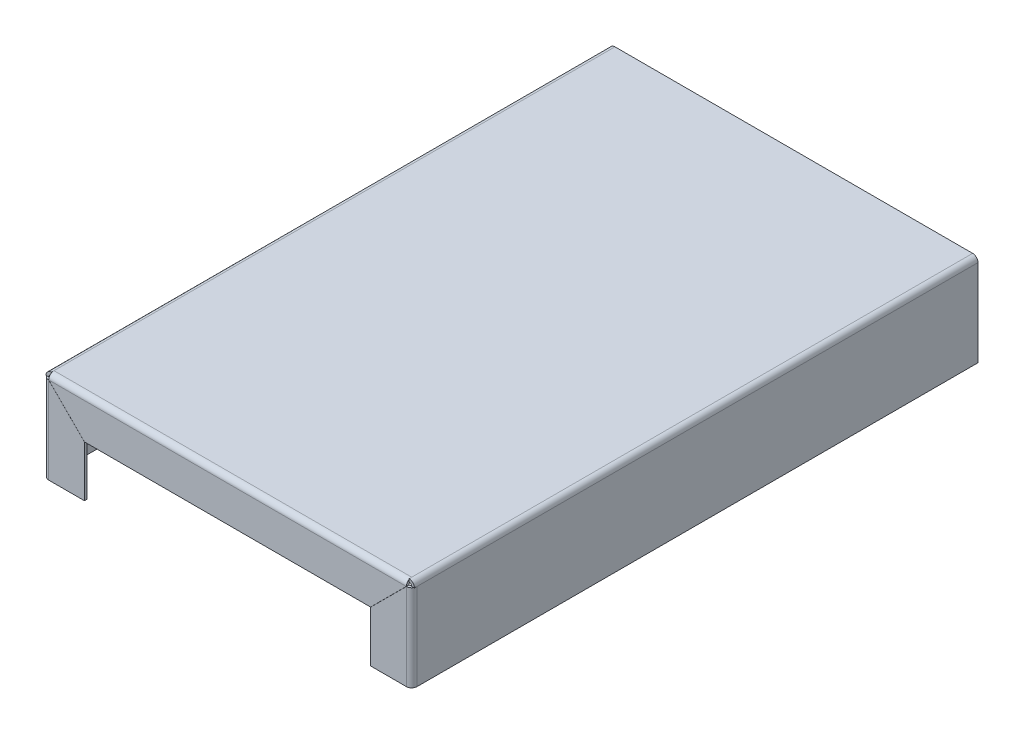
ISO-10303-21;
HEADER;
FILE_DESCRIPTION(('STEP AP214'),'2;1');
FILE_NAME('part.step','',(''),(''),'','','');
FILE_SCHEMA(('AUTOMOTIVE_DESIGN { 1 0 10303 214 1 1 1 1 }'));
ENDSEC;
DATA;
#1=APPLICATION_CONTEXT('core data for automotive mechanical design processes');
#2=APPLICATION_PROTOCOL_DEFINITION('international standard','automotive_design',2000,#1);
#3=PRODUCT_CONTEXT('',#1,'mechanical');
#4=PRODUCT('Part','Part','',(#3));
#5=PRODUCT_RELATED_PRODUCT_CATEGORY('part','',(#4));
#6=PRODUCT_DEFINITION_FORMATION('','',#4);
#7=PRODUCT_DEFINITION_CONTEXT('part definition',#1,'design');
#8=PRODUCT_DEFINITION('design','',#6,#7);
#9=PRODUCT_DEFINITION_SHAPE('','',#8);
#10=(LENGTH_UNIT() NAMED_UNIT(*) SI_UNIT(.MILLI.,.METRE.));
#11=(NAMED_UNIT(*) PLANE_ANGLE_UNIT() SI_UNIT($,.RADIAN.));
#12=(NAMED_UNIT(*) SI_UNIT($,.STERADIAN.) SOLID_ANGLE_UNIT());
#13=UNCERTAINTY_MEASURE_WITH_UNIT(LENGTH_MEASURE(1.E-05),#10,'distance_accuracy_value','');
#14=(GEOMETRIC_REPRESENTATION_CONTEXT(3) GLOBAL_UNCERTAINTY_ASSIGNED_CONTEXT((#13)) GLOBAL_UNIT_ASSIGNED_CONTEXT((#10,
#11,#12)) REPRESENTATION_CONTEXT('',''));
#15=CARTESIAN_POINT('',(0.,0.,0.));
#16=DIRECTION('',(0.,0.,1.));
#17=DIRECTION('',(1.,0.,0.));
#18=AXIS2_PLACEMENT_3D('',#15,#16,#17);
#19=CARTESIAN_POINT('',(50.0634,0.,155.448));
#20=DIRECTION('',(1.,0.,0.));
#21=DIRECTION('',(0.,0.,-1.));
#22=AXIS2_PLACEMENT_3D('',#19,#20,#21);
#23=PLANE('',#22);
#24=DIRECTION('',(0.,1.,0.));
#25=VECTOR('',#24,1.);
#26=CARTESIAN_POINT('',(50.0634,-1.4732,154.7114));
#27=LINE('',#26,#25);
#28=CARTESIAN_POINT('',(50.0634,-1.4732,154.7114));
#29=VERTEX_POINT('',#28);
#30=CARTESIAN_POINT('',(50.0634,-25.4,154.7114));
#31=VERTEX_POINT('',#30);
#32=EDGE_CURVE('E270',#29,#31,#27,.F.);
#33=ORIENTED_EDGE('',*,*,#32,.F.);
#34=DIRECTION('',(0.,0.,-1.));
#35=VECTOR('',#34,1.);
#36=CARTESIAN_POINT('',(50.0634,-1.4732,155.448));
#37=LINE('',#36,#35);
#38=CARTESIAN_POINT('',(50.0634,-1.4732,0.));
#39=VERTEX_POINT('',#38);
#40=EDGE_CURVE('E452',#29,#39,#37,.T.);
#41=ORIENTED_EDGE('',*,*,#40,.T.);
#42=DIRECTION('',(0.,1.,0.));
#43=VECTOR('',#42,1.);
#44=CARTESIAN_POINT('',(50.0634,0.,0.));
#45=LINE('',#44,#43);
#46=CARTESIAN_POINT('',(50.0634,-25.4,0.));
#47=VERTEX_POINT('',#46);
#48=EDGE_CURVE('E436',#39,#47,#45,.F.);
#49=ORIENTED_EDGE('',*,*,#48,.T.);
#50=DIRECTION('',(0.,0.,-1.));
#51=VECTOR('',#50,1.);
#52=CARTESIAN_POINT('',(50.0634,-25.4,155.448));
#53=LINE('',#52,#51);
#54=EDGE_CURVE('E524',#31,#47,#53,.T.);
#55=ORIENTED_EDGE('',*,*,#54,.F.);
#56=EDGE_LOOP('',(#33,#41,#49,#55));
#57=FACE_BOUND('',#56,.T.);
#58=ADVANCED_FACE('F45',(#57),#23,.F.);
#59=CARTESIAN_POINT('',(50.8,0.,155.448));
#60=DIRECTION('',(1.,0.,0.));
#61=DIRECTION('',(0.,0.,-1.));
#62=AXIS2_PLACEMENT_3D('',#59,#60,#61);
#63=PLANE('',#62);
#64=DIRECTION('',(0.,0.,-1.));
#65=VECTOR('',#64,1.);
#66=CARTESIAN_POINT('',(50.8,-1.4732,155.448));
#67=LINE('',#66,#65);
#68=CARTESIAN_POINT('',(50.8,-1.4732,154.7114));
#69=VERTEX_POINT('',#68);
#70=CARTESIAN_POINT('',(50.8,-1.4732,0.));
#71=VERTEX_POINT('',#70);
#72=EDGE_CURVE('E518',#69,#71,#67,.T.);
#73=ORIENTED_EDGE('',*,*,#72,.F.);
#74=DIRECTION('',(0.,1.,0.));
#75=VECTOR('',#74,1.);
#76=CARTESIAN_POINT('',(50.8,-1.4732,154.7114));
#77=LINE('',#76,#75);
#78=CARTESIAN_POINT('',(50.8,-25.4,154.7114));
#79=VERTEX_POINT('',#78);
#80=EDGE_CURVE('E265',#69,#79,#77,.F.);
#81=ORIENTED_EDGE('',*,*,#80,.T.);
#82=DIRECTION('',(0.,0.,-1.));
#83=VECTOR('',#82,1.);
#84=CARTESIAN_POINT('',(50.8,-25.4,155.448));
#85=LINE('',#84,#83);
#86=CARTESIAN_POINT('',(50.8,-25.4,0.));
#87=VERTEX_POINT('',#86);
#88=EDGE_CURVE('E522',#79,#87,#85,.T.);
#89=ORIENTED_EDGE('',*,*,#88,.T.);
#90=DIRECTION('',(0.,-1.,0.));
#91=VECTOR('',#90,1.);
#92=CARTESIAN_POINT('',(50.8,0.,0.));
#93=LINE('',#92,#91);
#94=EDGE_CURVE('E458',#71,#87,#93,.T.);
#95=ORIENTED_EDGE('',*,*,#94,.F.);
#96=EDGE_LOOP('',(#73,#81,#89,#95));
#97=FACE_BOUND('',#96,.T.);
#98=ADVANCED_FACE('F672',(#97),#63,.T.);
#99=CARTESIAN_POINT('',(-50.8,-25.4,155.448));
#100=DIRECTION('',(-1.,0.,0.));
#101=DIRECTION('',(0.,0.,1.));
#102=AXIS2_PLACEMENT_3D('',#99,#100,#101);
#103=PLANE('',#102);
#104=DIRECTION('',(0.,0.,-1.));
#105=VECTOR('',#104,1.);
#106=CARTESIAN_POINT('',(-50.8,-25.4,155.448));
#107=LINE('',#106,#105);
#108=CARTESIAN_POINT('',(-50.8,-25.4,154.7114));
#109=VERTEX_POINT('',#108);
#110=CARTESIAN_POINT('',(-50.8,-25.4,0.));
#111=VERTEX_POINT('',#110);
#112=EDGE_CURVE('E504',#109,#111,#107,.T.);
#113=ORIENTED_EDGE('',*,*,#112,.F.);
#114=DIRECTION('',(0.,-1.,0.));
#115=VECTOR('',#114,1.);
#116=CARTESIAN_POINT('',(-50.8,-25.4,154.7114));
#117=LINE('',#116,#115);
#118=CARTESIAN_POINT('',(-50.8,-1.4732,154.7114));
#119=VERTEX_POINT('',#118);
#120=EDGE_CURVE('E340',#109,#119,#117,.F.);
#121=ORIENTED_EDGE('',*,*,#120,.T.);
#122=DIRECTION('',(0.,0.,-1.));
#123=VECTOR('',#122,1.);
#124=CARTESIAN_POINT('',(-50.8,-1.4732,155.448));
#125=LINE('',#124,#123);
#126=CARTESIAN_POINT('',(-50.8,-1.4732,0.));
#127=VERTEX_POINT('',#126);
#128=EDGE_CURVE('E506',#119,#127,#125,.T.);
#129=ORIENTED_EDGE('',*,*,#128,.T.);
#130=DIRECTION('',(0.,1.,0.));
#131=VECTOR('',#130,1.);
#132=CARTESIAN_POINT('',(-50.8,-25.4,0.));
#133=LINE('',#132,#131);
#134=EDGE_CURVE('E470',#111,#127,#133,.T.);
#135=ORIENTED_EDGE('',*,*,#134,.F.);
#136=EDGE_LOOP('',(#113,#121,#129,#135));
#137=FACE_BOUND('',#136,.T.);
#138=ADVANCED_FACE('F606',(#137),#103,.T.);
#139=CARTESIAN_POINT('',(-50.0634,-25.4,155.448));
#140=DIRECTION('',(0.,-1.,0.));
#141=DIRECTION('',(0.,0.,-1.));
#142=AXIS2_PLACEMENT_3D('',#139,#140,#141);
#143=PLANE('',#142);
#144=DIRECTION('',(0.,0.,-1.));
#145=VECTOR('',#144,1.);
#146=CARTESIAN_POINT('',(-50.0634,-25.4,155.448));
#147=LINE('',#146,#145);
#148=CARTESIAN_POINT('',(-50.0634,-25.4,154.7114));
#149=VERTEX_POINT('',#148);
#150=CARTESIAN_POINT('',(-50.0634,-25.4,0.));
#151=VERTEX_POINT('',#150);
#152=EDGE_CURVE('E502',#149,#151,#147,.T.);
#153=ORIENTED_EDGE('',*,*,#152,.F.);
#154=DIRECTION('',(-1.,0.,0.));
#155=VECTOR('',#154,1.);
#156=CARTESIAN_POINT('',(-50.0634,-25.4,154.7114));
#157=LINE('',#156,#155);
#158=EDGE_CURVE('E339',#149,#109,#157,.T.);
#159=ORIENTED_EDGE('',*,*,#158,.T.);
#160=ORIENTED_EDGE('',*,*,#112,.T.);
#161=DIRECTION('',(-1.,0.,0.));
#162=VECTOR('',#161,1.);
#163=CARTESIAN_POINT('',(-50.0634,-25.4,0.));
#164=LINE('',#163,#162);
#165=EDGE_CURVE('E473',#151,#111,#164,.T.);
#166=ORIENTED_EDGE('',*,*,#165,.F.);
#167=EDGE_LOOP('',(#153,#159,#160,#166));
#168=FACE_BOUND('',#167,.T.);
#169=ADVANCED_FACE('F733',(#168),#143,.T.);
#170=CARTESIAN_POINT('',(-50.0634,-25.4,155.448));
#171=DIRECTION('',(-1.,0.,0.));
#172=DIRECTION('',(0.,0.,1.));
#173=AXIS2_PLACEMENT_3D('',#170,#171,#172);
#174=PLANE('',#173);
#175=DIRECTION('',(0.,-1.,0.));
#176=VECTOR('',#175,1.);
#177=CARTESIAN_POINT('',(-50.0634,-25.4,154.7114));
#178=LINE('',#177,#176);
#179=CARTESIAN_POINT('',(-50.0634,-1.4732,154.7114));
#180=VERTEX_POINT('',#179);
#181=EDGE_CURVE('E615',#149,#180,#178,.F.);
#182=ORIENTED_EDGE('',*,*,#181,.F.);
#183=ORIENTED_EDGE('',*,*,#152,.T.);
#184=DIRECTION('',(0.,1.,0.));
#185=VECTOR('',#184,1.);
#186=CARTESIAN_POINT('',(-50.0634,-25.4,0.));
#187=LINE('',#186,#185);
#188=CARTESIAN_POINT('',(-50.0634,-1.4732,0.));
#189=VERTEX_POINT('',#188);
#190=EDGE_CURVE('E476',#151,#189,#187,.T.);
#191=ORIENTED_EDGE('',*,*,#190,.T.);
#192=DIRECTION('',(0.,0.,-1.));
#193=VECTOR('',#192,1.);
#194=CARTESIAN_POINT('',(-50.0634,-1.4732,155.448));
#195=LINE('',#194,#193);
#196=EDGE_CURVE('E498',#180,#189,#195,.T.);
#197=ORIENTED_EDGE('',*,*,#196,.F.);
#198=EDGE_LOOP('',(#182,#183,#191,#197));
#199=FACE_BOUND('',#198,.T.);
#200=ADVANCED_FACE('F639',(#199),#174,.F.);
#201=CARTESIAN_POINT('',(-50.8,0.,155.448));
#202=DIRECTION('',(0.,1.,0.));
#203=DIRECTION('',(0.,0.,1.));
#204=AXIS2_PLACEMENT_3D('',#201,#202,#203);
#205=PLANE('',#204);
#206=DIRECTION('',(0.,0.,-1.));
#207=VECTOR('',#206,1.);
#208=CARTESIAN_POINT('',(-49.3268,0.,155.448));
#209=LINE('',#208,#207);
#210=CARTESIAN_POINT('',(-49.3268,0.,154.7114));
#211=VERTEX_POINT('',#210);
#212=CARTESIAN_POINT('',(-49.3268,0.,0.));
#213=VERTEX_POINT('',#212);
#214=EDGE_CURVE('E510',#211,#213,#209,.T.);
#215=ORIENTED_EDGE('',*,*,#214,.F.);
#216=DIRECTION('',(-1.,0.,0.));
#217=VECTOR('',#216,1.);
#218=CARTESIAN_POINT('',(-49.3268,0.,154.7114));
#219=LINE('',#218,#217);
#220=CARTESIAN_POINT('',(49.3268,0.,154.7114));
#221=VERTEX_POINT('',#220);
#222=EDGE_CURVE('E391',#211,#221,#219,.F.);
#223=ORIENTED_EDGE('',*,*,#222,.T.);
#224=DIRECTION('',(0.,0.,-1.));
#225=VECTOR('',#224,1.);
#226=CARTESIAN_POINT('',(49.3268,0.,155.448));
#227=LINE('',#226,#225);
#228=CARTESIAN_POINT('',(49.3268,0.,0.));
#229=VERTEX_POINT('',#228);
#230=EDGE_CURVE('E514',#221,#229,#227,.T.);
#231=ORIENTED_EDGE('',*,*,#230,.T.);
#232=DIRECTION('',(1.,0.,0.));
#233=VECTOR('',#232,1.);
#234=CARTESIAN_POINT('',(-50.8,0.,0.));
#235=LINE('',#234,#233);
#236=EDGE_CURVE('E464',#213,#229,#235,.T.);
#237=ORIENTED_EDGE('',*,*,#236,.F.);
#238=EDGE_LOOP('',(#215,#223,#231,#237));
#239=FACE_BOUND('',#238,.T.);
#240=ADVANCED_FACE('F579',(#239),#205,.T.);
#241=CARTESIAN_POINT('',(-50.8,-0.7366,155.448));
#242=DIRECTION('',(0.,1.,0.));
#243=DIRECTION('',(0.,0.,1.));
#244=AXIS2_PLACEMENT_3D('',#241,#242,#243);
#245=PLANE('',#244);
#246=DIRECTION('',(-1.,0.,0.));
#247=VECTOR('',#246,1.);
#248=CARTESIAN_POINT('',(-49.3268,-0.736600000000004,154.7114));
#249=LINE('',#248,#247);
#250=CARTESIAN_POINT('',(-49.3268,-0.736600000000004,154.7114));
#251=VERTEX_POINT('',#250);
#252=CARTESIAN_POINT('',(49.3268,-0.736600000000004,154.7114));
#253=VERTEX_POINT('',#252);
#254=EDGE_CURVE('E383',#251,#253,#249,.F.);
#255=ORIENTED_EDGE('',*,*,#254,.F.);
#256=DIRECTION('',(0.,0.,-1.));
#257=VECTOR('',#256,1.);
#258=CARTESIAN_POINT('',(-49.3268,-0.7366,155.448));
#259=LINE('',#258,#257);
#260=CARTESIAN_POINT('',(-49.3268,-0.7366,0.));
#261=VERTEX_POINT('',#260);
#262=EDGE_CURVE('E494',#251,#261,#259,.T.);
#263=ORIENTED_EDGE('',*,*,#262,.T.);
#264=DIRECTION('',(1.,0.,0.));
#265=VECTOR('',#264,1.);
#266=CARTESIAN_POINT('',(-50.8,-0.7366,0.));
#267=LINE('',#266,#265);
#268=CARTESIAN_POINT('',(49.3268,-0.7366,0.));
#269=VERTEX_POINT('',#268);
#270=EDGE_CURVE('E482',#261,#269,#267,.T.);
#271=ORIENTED_EDGE('',*,*,#270,.T.);
#272=DIRECTION('',(0.,0.,-1.));
#273=VECTOR('',#272,1.);
#274=CARTESIAN_POINT('',(49.3268,-0.7366,155.448));
#275=LINE('',#274,#273);
#276=EDGE_CURVE('E490',#253,#269,#275,.T.);
#277=ORIENTED_EDGE('',*,*,#276,.F.);
#278=EDGE_LOOP('',(#255,#263,#271,#277));
#279=FACE_BOUND('',#278,.T.);
#280=ADVANCED_FACE('F561',(#279),#245,.F.);
#281=CARTESIAN_POINT('',(-49.3268,0.,155.448));
#282=DIRECTION('',(0.,0.,1.));
#283=DIRECTION('',(1.,0.,0.));
#284=AXIS2_PLACEMENT_3D('',#281,#282,#283);
#285=PLANE('',#284);
#286=DIRECTION('',(0.,-1.,0.));
#287=VECTOR('',#286,1.);
#288=CARTESIAN_POINT('',(-49.3268,0.,155.448));
#289=LINE('',#288,#287);
#290=CARTESIAN_POINT('',(-49.3268,0.,155.448));
#291=VERTEX_POINT('',#290);
#292=CARTESIAN_POINT('',(-49.3268,-0.7366,155.448));
#293=VERTEX_POINT('',#292);
#294=EDGE_CURVE('E13',#291,#293,#289,.T.);
#295=ORIENTED_EDGE('',*,*,#294,.F.);
#296=CARTESIAN_POINT('',(-49.3268,-1.4732,155.448));
#297=DIRECTION('',(0.,0.,1.));
#298=DIRECTION('',(1.,0.,0.));
#299=AXIS2_PLACEMENT_3D('',#296,#297,#298);
#300=CIRCLE('',#299,1.4732);
#301=CARTESIAN_POINT('',(-50.8,-1.4732,155.448));
#302=VERTEX_POINT('',#301);
#303=EDGE_CURVE('E443',#302,#291,#300,.F.);
#304=ORIENTED_EDGE('',*,*,#303,.F.);
#305=DIRECTION('',(-1.,0.,0.));
#306=VECTOR('',#305,1.);
#307=CARTESIAN_POINT('',(-50.0634,-1.4732,155.448));
#308=LINE('',#307,#306);
#309=CARTESIAN_POINT('',(-50.0634,-1.4732,155.448));
#310=VERTEX_POINT('',#309);
#311=EDGE_CURVE('E53',#310,#302,#308,.T.);
#312=ORIENTED_EDGE('',*,*,#311,.F.);
#313=CARTESIAN_POINT('',(-49.3268,-1.4732,155.448));
#314=DIRECTION('',(0.,0.,1.));
#315=DIRECTION('',(1.,0.,0.));
#316=AXIS2_PLACEMENT_3D('',#313,#314,#315);
#317=CIRCLE('',#316,0.7366);
#318=EDGE_CURVE('E447',#310,#293,#317,.F.);
#319=ORIENTED_EDGE('',*,*,#318,.T.);
#320=EDGE_LOOP('',(#295,#304,#312,#319));
#321=FACE_BOUND('',#320,.T.);
#322=ADVANCED_FACE('F47',(#321),#285,.T.);
#323=CARTESIAN_POINT('',(-50.8,-1.4732,0.));
#324=DIRECTION('',(0.,0.,-1.));
#325=DIRECTION('',(-1.,0.,0.));
#326=AXIS2_PLACEMENT_3D('',#323,#324,#325);
#327=PLANE('',#326);
#328=DIRECTION('',(1.,0.,0.));
#329=VECTOR('',#328,1.);
#330=CARTESIAN_POINT('',(-50.8,-1.4732,0.));
#331=LINE('',#330,#329);
#332=EDGE_CURVE('E540',#127,#189,#331,.T.);
#333=ORIENTED_EDGE('',*,*,#332,.F.);
#334=CARTESIAN_POINT('',(-49.3268,-1.4732,0.));
#335=DIRECTION('',(0.,0.,1.));
#336=DIRECTION('',(1.,0.,0.));
#337=AXIS2_PLACEMENT_3D('',#334,#335,#336);
#338=CIRCLE('',#337,1.4732);
#339=EDGE_CURVE('E467',#127,#213,#338,.F.);
#340=ORIENTED_EDGE('',*,*,#339,.T.);
#341=DIRECTION('',(0.,1.,0.));
#342=VECTOR('',#341,1.);
#343=CARTESIAN_POINT('',(-49.3268,-0.7366,0.));
#344=LINE('',#343,#342);
#345=EDGE_CURVE('E537',#261,#213,#344,.T.);
#346=ORIENTED_EDGE('',*,*,#345,.F.);
#347=CARTESIAN_POINT('',(-49.3268,-1.4732,0.));
#348=DIRECTION('',(0.,0.,1.));
#349=DIRECTION('',(1.,0.,0.));
#350=AXIS2_PLACEMENT_3D('',#347,#348,#349);
#351=CIRCLE('',#350,0.7366);
#352=EDGE_CURVE('E479',#189,#261,#351,.F.);
#353=ORIENTED_EDGE('',*,*,#352,.F.);
#354=EDGE_LOOP('',(#333,#340,#346,#353));
#355=FACE_BOUND('',#354,.T.);
#356=ADVANCED_FACE('F594',(#355),#327,.T.);
#357=CARTESIAN_POINT('',(-49.3268,-0.7366,0.));
#358=DIRECTION('',(0.,0.,-1.));
#359=DIRECTION('',(-1.,0.,0.));
#360=AXIS2_PLACEMENT_3D('',#357,#358,#359);
#361=PLANE('',#360);
#362=ORIENTED_EDGE('',*,*,#134,.T.);
#363=ORIENTED_EDGE('',*,*,#332,.T.);
#364=ORIENTED_EDGE('',*,*,#190,.F.);
#365=ORIENTED_EDGE('',*,*,#165,.T.);
#366=EDGE_LOOP('',(#362,#363,#364,#365));
#367=FACE_BOUND('',#366,.T.);
#368=ADVANCED_FACE('F601',(#367),#361,.T.);
#369=CARTESIAN_POINT('',(50.8,-1.4732,155.448));
#370=DIRECTION('',(0.,0.,1.));
#371=DIRECTION('',(1.,0.,0.));
#372=AXIS2_PLACEMENT_3D('',#369,#370,#371);
#373=PLANE('',#372);
#374=DIRECTION('',(-1.,0.,0.));
#375=VECTOR('',#374,1.);
#376=CARTESIAN_POINT('',(50.8,-1.4732,155.448));
#377=LINE('',#376,#375);
#378=CARTESIAN_POINT('',(50.8,-1.4732,155.448));
#379=VERTEX_POINT('',#378);
#380=CARTESIAN_POINT('',(50.0634,-1.4732,155.448));
#381=VERTEX_POINT('',#380);
#382=EDGE_CURVE('E534',#379,#381,#377,.T.);
#383=ORIENTED_EDGE('',*,*,#382,.F.);
#384=CARTESIAN_POINT('',(49.3268,-1.4732,155.448));
#385=DIRECTION('',(0.,0.,1.));
#386=DIRECTION('',(1.,0.,0.));
#387=AXIS2_PLACEMENT_3D('',#384,#385,#386);
#388=CIRCLE('',#387,1.4732);
#389=CARTESIAN_POINT('',(49.3268,0.,155.448));
#390=VERTEX_POINT('',#389);
#391=EDGE_CURVE('E440',#390,#379,#388,.F.);
#392=ORIENTED_EDGE('',*,*,#391,.F.);
#393=DIRECTION('',(0.,1.,0.));
#394=VECTOR('',#393,1.);
#395=CARTESIAN_POINT('',(49.3268,-0.7366,155.448));
#396=LINE('',#395,#394);
#397=CARTESIAN_POINT('',(49.3268,-0.7366,155.448));
#398=VERTEX_POINT('',#397);
#399=EDGE_CURVE('E532',#398,#390,#396,.T.);
#400=ORIENTED_EDGE('',*,*,#399,.F.);
#401=CARTESIAN_POINT('',(49.3268,-1.4732,155.448));
#402=DIRECTION('',(0.,0.,1.));
#403=DIRECTION('',(1.,0.,0.));
#404=AXIS2_PLACEMENT_3D('',#401,#402,#403);
#405=CIRCLE('',#404,0.7366);
#406=EDGE_CURVE('E450',#398,#381,#405,.F.);
#407=ORIENTED_EDGE('',*,*,#406,.T.);
#408=EDGE_LOOP('',(#383,#392,#400,#407));
#409=FACE_BOUND('',#408,.T.);
#410=ADVANCED_FACE('F662',(#409),#373,.T.);
#411=CARTESIAN_POINT('',(49.3268,0.,0.));
#412=DIRECTION('',(0.,0.,-1.));
#413=DIRECTION('',(-1.,0.,0.));
#414=AXIS2_PLACEMENT_3D('',#411,#412,#413);
#415=PLANE('',#414);
#416=DIRECTION('',(0.,-1.,0.));
#417=VECTOR('',#416,1.);
#418=CARTESIAN_POINT('',(49.3268,0.,0.));
#419=LINE('',#418,#417);
#420=EDGE_CURVE('E529',#229,#269,#419,.T.);
#421=ORIENTED_EDGE('',*,*,#420,.F.);
#422=CARTESIAN_POINT('',(49.3268,-1.4732,0.));
#423=DIRECTION('',(0.,0.,1.));
#424=DIRECTION('',(1.,0.,0.));
#425=AXIS2_PLACEMENT_3D('',#422,#423,#424);
#426=CIRCLE('',#425,1.4732);
#427=EDGE_CURVE('E461',#229,#71,#426,.F.);
#428=ORIENTED_EDGE('',*,*,#427,.T.);
#429=DIRECTION('',(1.,0.,0.));
#430=VECTOR('',#429,1.);
#431=CARTESIAN_POINT('',(50.0634,-1.4732,0.));
#432=LINE('',#431,#430);
#433=EDGE_CURVE('E526',#39,#71,#432,.T.);
#434=ORIENTED_EDGE('',*,*,#433,.F.);
#435=CARTESIAN_POINT('',(49.3268,-1.4732,0.));
#436=DIRECTION('',(0.,0.,1.));
#437=DIRECTION('',(1.,0.,0.));
#438=AXIS2_PLACEMENT_3D('',#435,#436,#437);
#439=CIRCLE('',#438,0.7366);
#440=EDGE_CURVE('E444',#269,#39,#439,.F.);
#441=ORIENTED_EDGE('',*,*,#440,.F.);
#442=EDGE_LOOP('',(#421,#428,#434,#441));
#443=FACE_BOUND('',#442,.T.);
#444=ADVANCED_FACE('F641',(#443),#415,.T.);
#445=CARTESIAN_POINT('',(50.0634,-1.4732,0.));
#446=DIRECTION('',(0.,0.,-1.));
#447=DIRECTION('',(-1.,0.,0.));
#448=AXIS2_PLACEMENT_3D('',#445,#446,#447);
#449=PLANE('',#448);
#450=ORIENTED_EDGE('',*,*,#236,.T.);
#451=ORIENTED_EDGE('',*,*,#420,.T.);
#452=ORIENTED_EDGE('',*,*,#270,.F.);
#453=ORIENTED_EDGE('',*,*,#345,.T.);
#454=EDGE_LOOP('',(#450,#451,#452,#453));
#455=FACE_BOUND('',#454,.T.);
#456=ADVANCED_FACE('F589',(#455),#449,.T.);
#457=CARTESIAN_POINT('',(50.8,-25.4,155.448));
#458=DIRECTION('',(0.,-1.,0.));
#459=DIRECTION('',(0.,0.,-1.));
#460=AXIS2_PLACEMENT_3D('',#457,#458,#459);
#461=PLANE('',#460);
#462=DIRECTION('',(1.,0.,0.));
#463=VECTOR('',#462,1.);
#464=CARTESIAN_POINT('',(50.0634,-25.4,154.7114));
#465=LINE('',#464,#463);
#466=EDGE_CURVE('E693',#31,#79,#465,.T.);
#467=ORIENTED_EDGE('',*,*,#466,.F.);
#468=ORIENTED_EDGE('',*,*,#54,.T.);
#469=DIRECTION('',(-1.,0.,0.));
#470=VECTOR('',#469,1.);
#471=CARTESIAN_POINT('',(50.8,-25.4,0.));
#472=LINE('',#471,#470);
#473=EDGE_CURVE('E455',#87,#47,#472,.T.);
#474=ORIENTED_EDGE('',*,*,#473,.F.);
#475=ORIENTED_EDGE('',*,*,#88,.F.);
#476=EDGE_LOOP('',(#467,#468,#474,#475));
#477=FACE_BOUND('',#476,.T.);
#478=ADVANCED_FACE('F681',(#477),#461,.T.);
#479=CARTESIAN_POINT('',(49.3268,-1.4732,155.448));
#480=DIRECTION('',(0.,0.,-1.));
#481=DIRECTION('',(-1.,0.,0.));
#482=AXIS2_PLACEMENT_3D('',#479,#480,#481);
#483=CYLINDRICAL_SURFACE('',#482,1.4732);
#484=ORIENTED_EDGE('',*,*,#427,.F.);
#485=ORIENTED_EDGE('',*,*,#230,.F.);
#486=EDGE_CURVE('E515',#390,#221,#227,.T.);
#487=ORIENTED_EDGE('',*,*,#486,.F.);
#488=ORIENTED_EDGE('',*,*,#391,.T.);
#489=EDGE_CURVE('E519',#379,#69,#67,.T.);
#490=ORIENTED_EDGE('',*,*,#489,.T.);
#491=ORIENTED_EDGE('',*,*,#72,.T.);
#492=EDGE_LOOP('',(#484,#485,#487,#488,#490,#491));
#493=FACE_BOUND('',#492,.T.);
#494=ADVANCED_FACE('F584',(#493),#483,.T.);
#495=CARTESIAN_POINT('',(-49.3268,-1.4732,155.448));
#496=DIRECTION('',(0.,0.,-1.));
#497=DIRECTION('',(-1.,0.,0.));
#498=AXIS2_PLACEMENT_3D('',#495,#496,#497);
#499=CYLINDRICAL_SURFACE('',#498,1.4732);
#500=ORIENTED_EDGE('',*,*,#339,.F.);
#501=ORIENTED_EDGE('',*,*,#128,.F.);
#502=EDGE_CURVE('E507',#302,#119,#125,.T.);
#503=ORIENTED_EDGE('',*,*,#502,.F.);
#504=ORIENTED_EDGE('',*,*,#303,.T.);
#505=EDGE_CURVE('E511',#291,#211,#209,.T.);
#506=ORIENTED_EDGE('',*,*,#505,.T.);
#507=ORIENTED_EDGE('',*,*,#214,.T.);
#508=EDGE_LOOP('',(#500,#501,#503,#504,#506,#507));
#509=FACE_BOUND('',#508,.T.);
#510=ADVANCED_FACE('F598',(#509),#499,.T.);
#511=CARTESIAN_POINT('',(-49.3268,-1.4732,155.448));
#512=DIRECTION('',(0.,0.,-1.));
#513=DIRECTION('',(-1.,0.,0.));
#514=AXIS2_PLACEMENT_3D('',#511,#512,#513);
#515=CYLINDRICAL_SURFACE('',#514,0.7366);
#516=ORIENTED_EDGE('',*,*,#352,.T.);
#517=ORIENTED_EDGE('',*,*,#262,.F.);
#518=EDGE_CURVE('E495',#293,#251,#259,.T.);
#519=ORIENTED_EDGE('',*,*,#518,.F.);
#520=ORIENTED_EDGE('',*,*,#318,.F.);
#521=EDGE_CURVE('E499',#310,#180,#195,.T.);
#522=ORIENTED_EDGE('',*,*,#521,.T.);
#523=ORIENTED_EDGE('',*,*,#196,.T.);
#524=EDGE_LOOP('',(#516,#517,#519,#520,#522,#523));
#525=FACE_BOUND('',#524,.T.);
#526=ADVANCED_FACE('F553',(#525),#515,.F.);
#527=CARTESIAN_POINT('',(49.3268,-1.4732,155.448));
#528=DIRECTION('',(0.,0.,-1.));
#529=DIRECTION('',(-1.,0.,0.));
#530=AXIS2_PLACEMENT_3D('',#527,#528,#529);
#531=CYLINDRICAL_SURFACE('',#530,0.7366);
#532=ORIENTED_EDGE('',*,*,#440,.T.);
#533=ORIENTED_EDGE('',*,*,#40,.F.);
#534=EDGE_CURVE('E487',#381,#29,#37,.T.);
#535=ORIENTED_EDGE('',*,*,#534,.F.);
#536=ORIENTED_EDGE('',*,*,#406,.F.);
#537=EDGE_CURVE('E491',#398,#253,#275,.T.);
#538=ORIENTED_EDGE('',*,*,#537,.T.);
#539=ORIENTED_EDGE('',*,*,#276,.T.);
#540=EDGE_LOOP('',(#532,#533,#535,#536,#538,#539));
#541=FACE_BOUND('',#540,.T.);
#542=ADVANCED_FACE('F645',(#541),#531,.F.);
#543=CARTESIAN_POINT('',(49.3268,-1.4732,0.));
#544=DIRECTION('',(0.,0.,1.));
#545=DIRECTION('',(1.,0.,0.));
#546=AXIS2_PLACEMENT_3D('',#543,#544,#545);
#547=PLANE('',#546);
#548=ORIENTED_EDGE('',*,*,#48,.F.);
#549=ORIENTED_EDGE('',*,*,#433,.T.);
#550=ORIENTED_EDGE('',*,*,#94,.T.);
#551=ORIENTED_EDGE('',*,*,#473,.T.);
#552=EDGE_LOOP('',(#548,#549,#550,#551));
#553=FACE_BOUND('',#552,.T.);
#554=ADVANCED_FACE('F649',(#553),#547,.F.);
#555=CARTESIAN_POINT('',(-49.3268,-0.7366,155.448));
#556=DIRECTION('',(1.,0.,0.));
#557=DIRECTION('',(0.,0.,-1.));
#558=AXIS2_PLACEMENT_3D('',#555,#556,#557);
#559=PLANE('',#558);
#560=ORIENTED_EDGE('',*,*,#505,.F.);
#561=ORIENTED_EDGE('',*,*,#294,.T.);
#562=ORIENTED_EDGE('',*,*,#518,.T.);
#563=DIRECTION('',(0.,1.,0.));
#564=VECTOR('',#563,1.);
#565=CARTESIAN_POINT('',(-49.3268,-0.736600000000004,154.7114));
#566=LINE('',#565,#564);
#567=EDGE_CURVE('E437',#251,#211,#566,.T.);
#568=ORIENTED_EDGE('',*,*,#567,.T.);
#569=EDGE_LOOP('',(#560,#561,#562,#568));
#570=FACE_BOUND('',#569,.T.);
#571=ADVANCED_FACE('F557',(#570),#559,.T.);
#572=CARTESIAN_POINT('',(49.3268,-0.736600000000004,154.7114));
#573=DIRECTION('',(-1.,0.,0.));
#574=DIRECTION('',(0.,0.,1.));
#575=AXIS2_PLACEMENT_3D('',#572,#573,#574);
#576=PLANE('',#575);
#577=ORIENTED_EDGE('',*,*,#486,.T.);
#578=DIRECTION('',(0.,1.,0.));
#579=VECTOR('',#578,1.);
#580=CARTESIAN_POINT('',(49.3268,-0.736600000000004,154.7114));
#581=LINE('',#580,#579);
#582=EDGE_CURVE('E428',#253,#221,#581,.T.);
#583=ORIENTED_EDGE('',*,*,#582,.F.);
#584=ORIENTED_EDGE('',*,*,#537,.F.);
#585=ORIENTED_EDGE('',*,*,#399,.T.);
#586=EDGE_LOOP('',(#577,#583,#584,#585));
#587=FACE_BOUND('',#586,.T.);
#588=ADVANCED_FACE('F571',(#587),#576,.T.);
#589=CARTESIAN_POINT('',(-50.0634,-1.4732,154.7114));
#590=DIRECTION('',(0.,-1.,0.));
#591=DIRECTION('',(0.,0.,-1.));
#592=AXIS2_PLACEMENT_3D('',#589,#590,#591);
#593=PLANE('',#592);
#594=ORIENTED_EDGE('',*,*,#502,.T.);
#595=DIRECTION('',(-1.,0.,0.));
#596=VECTOR('',#595,1.);
#597=CARTESIAN_POINT('',(-50.0634,-1.4732,154.7114));
#598=LINE('',#597,#596);
#599=EDGE_CURVE('E349',#180,#119,#598,.T.);
#600=ORIENTED_EDGE('',*,*,#599,.F.);
#601=ORIENTED_EDGE('',*,*,#521,.F.);
#602=ORIENTED_EDGE('',*,*,#311,.T.);
#603=EDGE_LOOP('',(#594,#600,#601,#602));
#604=FACE_BOUND('',#603,.T.);
#605=ADVANCED_FACE('F545',(#604),#593,.T.);
#606=CARTESIAN_POINT('',(50.0634,-1.4732,155.448));
#607=DIRECTION('',(0.,-1.,0.));
#608=DIRECTION('',(0.,0.,-1.));
#609=AXIS2_PLACEMENT_3D('',#606,#607,#608);
#610=PLANE('',#609);
#611=ORIENTED_EDGE('',*,*,#489,.F.);
#612=ORIENTED_EDGE('',*,*,#382,.T.);
#613=ORIENTED_EDGE('',*,*,#534,.T.);
#614=DIRECTION('',(1.,0.,0.));
#615=VECTOR('',#614,1.);
#616=CARTESIAN_POINT('',(50.0634,-1.4732,154.7114));
#617=LINE('',#616,#615);
#618=EDGE_CURVE('E264',#29,#69,#617,.T.);
#619=ORIENTED_EDGE('',*,*,#618,.T.);
#620=EDGE_LOOP('',(#611,#612,#613,#619));
#621=FACE_BOUND('',#620,.T.);
#622=ADVANCED_FACE('F659',(#621),#610,.T.);
#623=CARTESIAN_POINT('',(49.3268,0.0073659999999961,154.7114));
#624=CARTESIAN_POINT('',(49.3253030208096,0.00736599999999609,154.905240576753));
#625=CARTESIAN_POINT('',(49.323806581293,-0.0311691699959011,155.098935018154));
#626=CARTESIAN_POINT('',(49.3208131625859,-0.179501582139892,155.457041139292));
#627=CARTESIAN_POINT('',(49.3193164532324,-0.2892404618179,155.621276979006));
#628=CARTESIAN_POINT('',(49.3163230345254,-0.563323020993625,155.895359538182));
#629=CARTESIAN_POINT('',(49.3148263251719,-0.727558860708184,156.00509841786));
#630=CARTESIAN_POINT('',(49.3118329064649,-1.08566498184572,156.153430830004));
#631=CARTESIAN_POINT('',(49.3103364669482,-1.27935942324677,156.191966));
#632=CARTESIAN_POINT('',(49.3088394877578,-1.47320000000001,156.191966));
#633=CARTESIAN_POINT('',(49.3268,0.,154.7114));
#634=CARTESIAN_POINT('',(49.3253030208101,0.,154.904276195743));
#635=CARTESIAN_POINT('',(49.323806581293,-0.0383434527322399,155.097006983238));
#636=CARTESIAN_POINT('',(49.3208131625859,-0.185937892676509,155.453331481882));
#637=CARTESIAN_POINT('',(49.3193164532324,-0.295130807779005,155.616750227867));
#638=CARTESIAN_POINT('',(49.3163230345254,-0.567849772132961,155.889469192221));
#639=CARTESIAN_POINT('',(49.3148263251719,-0.731268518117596,155.998662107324));
#640=CARTESIAN_POINT('',(49.3118329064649,-1.08759301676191,156.146256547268));
#641=CARTESIAN_POINT('',(49.3103364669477,-1.28032380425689,156.1846));
#642=CARTESIAN_POINT('',(49.3088394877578,-1.47320000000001,156.1846));
#643=CARTESIAN_POINT('',(49.3268,-0.736600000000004,154.7114));
#644=CARTESIAN_POINT('',(49.3253030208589,-0.736600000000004,154.807838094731));
#645=CARTESIAN_POINT('',(49.323806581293,-0.755771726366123,154.904203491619));
#646=CARTESIAN_POINT('',(49.3208131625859,-0.829568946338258,155.082365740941));
#647=CARTESIAN_POINT('',(49.3193164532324,-0.884165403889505,155.164075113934));
#648=CARTESIAN_POINT('',(49.3163230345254,-1.02052488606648,155.300434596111));
#649=CARTESIAN_POINT('',(49.3148263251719,-1.1022342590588,155.355031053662));
#650=CARTESIAN_POINT('',(49.3118329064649,-1.28039650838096,155.428828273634));
#651=CARTESIAN_POINT('',(49.310336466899,-1.37676190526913,155.448));
#652=CARTESIAN_POINT('',(49.3088394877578,-1.47320000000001,155.448));
#653=CARTESIAN_POINT('',(49.3268,-0.744039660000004,154.7114));
#654=CARTESIAN_POINT('',(49.3253030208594,-0.744039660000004,154.806864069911));
#655=CARTESIAN_POINT('',(49.323806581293,-0.763017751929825,154.902256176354));
#656=CARTESIAN_POINT('',(49.3208131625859,-0.836069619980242,155.078618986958));
#657=CARTESIAN_POINT('',(49.3193164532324,-0.890114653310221,155.159503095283));
#658=CARTESIAN_POINT('',(49.3163230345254,-1.02509690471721,155.29448534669));
#659=CARTESIAN_POINT('',(49.3148263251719,-1.10598101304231,155.34853038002));
#660=CARTESIAN_POINT('',(49.3118329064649,-1.28234382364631,155.42158224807));
#661=CARTESIAN_POINT('',(49.3103364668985,-1.37773593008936,155.44056034));
#662=CARTESIAN_POINT('',(49.3088394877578,-1.47320000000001,155.44056034));
#663=B_SPLINE_SURFACE_WITH_KNOTS('',1,3,((#623,#624,#625,#626,#627,#628,#629,#630,#631,#632),
(#633,#634,#635,#636,#637,#638,#639,#640,#641,#642),(#643,#644,#645,#646,#647,#648,#649,#650,
#651,#652),(#653,#654,#655,#656,#657,#658,#659,#660,#661,#662)),.UNSPECIFIED.,.F.,.F.,.F.,(2,1,
1,2),(4,2,2,2,4),(-0.01,0.,1.,1.0101),(0.,0.25,0.5,0.75,1.),.UNSPECIFIED.);
#664=DIRECTION('',(0.,0.,-1.));
#665=VECTOR('',#664,1.);
#666=CARTESIAN_POINT('',(49.3088394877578,-1.47320000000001,155.448));
#667=LINE('',#666,#665);
#668=CARTESIAN_POINT('',(49.3088394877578,-1.4732,156.1846));
#669=VERTEX_POINT('',#668);
#670=CARTESIAN_POINT('',(49.3088394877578,-1.47320000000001,155.448));
#671=VERTEX_POINT('',#670);
#672=EDGE_CURVE('E380',#669,#671,#667,.T.);
#673=CARTESIAN_POINT('',(49.3268,-0.736600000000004,154.7114));
#674=CARTESIAN_POINT('',(49.3266129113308,-0.736599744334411,154.723452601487));
#675=CARTESIAN_POINT('',(49.3264258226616,-0.736895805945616,154.735505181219));
#676=CARTESIAN_POINT('',(49.3260516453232,-0.738078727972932,154.7595813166));
#677=CARTESIAN_POINT('',(49.325864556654,-0.738965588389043,154.771604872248));
#678=CARTESIAN_POINT('',(49.3254903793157,-0.741328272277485,154.795593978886));
#679=CARTESIAN_POINT('',(49.3253032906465,-0.742804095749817,154.807559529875));
#680=CARTESIAN_POINT('',(49.3249291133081,-0.746341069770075,154.831403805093));
#681=CARTESIAN_POINT('',(49.3247420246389,-0.748402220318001,154.843282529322));
#682=CARTESIAN_POINT('',(49.3243678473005,-0.753104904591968,154.866924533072));
#683=CARTESIAN_POINT('',(49.3241807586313,-0.75574643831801,154.878687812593));
#684=CARTESIAN_POINT('',(49.323806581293,-0.761603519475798,154.90207058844));
#685=CARTESIAN_POINT('',(49.3236194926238,-0.764819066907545,154.913690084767));
#686=CARTESIAN_POINT('',(49.3232453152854,-0.771816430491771,154.936757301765));
#687=CARTESIAN_POINT('',(49.3230582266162,-0.775598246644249,154.948205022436));
#688=CARTESIAN_POINT('',(49.3226840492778,-0.783719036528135,154.970901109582));
#689=CARTESIAN_POINT('',(49.3224969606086,-0.788058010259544,154.982149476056));
#690=CARTESIAN_POINT('',(49.3221227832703,-0.797282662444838,155.004419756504));
#691=CARTESIAN_POINT('',(49.3219356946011,-0.802168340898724,155.015441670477));
#692=CARTESIAN_POINT('',(49.3215615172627,-0.812474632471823,155.037232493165));
#693=CARTESIAN_POINT('',(49.3213744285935,-0.817895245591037,155.048001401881));
#694=CARTESIAN_POINT('',(49.3210002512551,-0.829258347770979,155.069260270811));
#695=CARTESIAN_POINT('',(49.3208131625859,-0.835200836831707,155.079750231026));
#696=CARTESIAN_POINT('',(49.3204389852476,-0.847593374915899,155.10042593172));
#697=CARTESIAN_POINT('',(49.3202518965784,-0.854043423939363,155.1106116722));
#698=CARTESIAN_POINT('',(49.31987771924,-0.867435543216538,155.130654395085));
#699=CARTESIAN_POINT('',(49.3196906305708,-0.874377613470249,155.140511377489));
#700=CARTESIAN_POINT('',(49.3193164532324,-0.888737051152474,155.159872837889));
#701=CARTESIAN_POINT('',(49.3191293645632,-0.896154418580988,155.169377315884));
#702=CARTESIAN_POINT('',(49.3187551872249,-0.911446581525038,155.188010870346));
#703=CARTESIAN_POINT('',(49.3185680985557,-0.919321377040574,155.197139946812));
#704=CARTESIAN_POINT('',(49.3181939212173,-0.935509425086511,155.215000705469));
#705=CARTESIAN_POINT('',(49.3180068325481,-0.943822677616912,155.223732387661));
#706=CARTESIAN_POINT('',(49.3176326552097,-0.960867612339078,155.240777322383));
#707=CARTESIAN_POINT('',(49.3174455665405,-0.969599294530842,155.249090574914));
#708=CARTESIAN_POINT('',(49.3170713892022,-0.987460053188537,155.265278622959));
#709=CARTESIAN_POINT('',(49.316884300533,-0.996589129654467,155.273153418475));
#710=CARTESIAN_POINT('',(49.3165101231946,-1.01522268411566,155.288445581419));
#711=CARTESIAN_POINT('',(49.3163230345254,-1.02472716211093,155.295862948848));
#712=CARTESIAN_POINT('',(49.315948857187,-1.04408862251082,155.31022238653));
#713=CARTESIAN_POINT('',(49.3157617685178,-1.05394560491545,155.317164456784));
#714=CARTESIAN_POINT('',(49.3153875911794,-1.07398832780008,155.330556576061));
#715=CARTESIAN_POINT('',(49.3152005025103,-1.08417406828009,155.337006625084));
#716=CARTESIAN_POINT('',(49.3148263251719,-1.10484976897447,155.349399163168));
#717=CARTESIAN_POINT('',(49.3146392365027,-1.11533972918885,155.355341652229));
#718=CARTESIAN_POINT('',(49.3142650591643,-1.13659859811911,155.366704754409));
#719=CARTESIAN_POINT('',(49.3140779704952,-1.14736750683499,155.372125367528));
#720=CARTESIAN_POINT('',(49.3137037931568,-1.16915832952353,155.382431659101));
#721=CARTESIAN_POINT('',(49.3135167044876,-1.18018024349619,155.387317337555));
#722=CARTESIAN_POINT('',(49.3131425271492,-1.20245052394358,155.396541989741));
#723=CARTESIAN_POINT('',(49.31295543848,-1.21369889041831,155.400880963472));
#724=CARTESIAN_POINT('',(49.3125812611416,-1.23639497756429,155.409001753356));
#725=CARTESIAN_POINT('',(49.3123941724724,-1.24784269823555,155.412783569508));
#726=CARTESIAN_POINT('',(49.3120199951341,-1.27090991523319,155.419780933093));
#727=CARTESIAN_POINT('',(49.3118329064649,-1.28252941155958,155.422996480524));
#728=CARTESIAN_POINT('',(49.3114587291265,-1.30591218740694,155.428853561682));
#729=CARTESIAN_POINT('',(49.3112716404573,-1.3176754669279,155.431495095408));
#730=CARTESIAN_POINT('',(49.3108974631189,-1.34131747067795,155.436197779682));
#731=CARTESIAN_POINT('',(49.3107103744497,-1.35319619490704,155.43825893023));
#732=CARTESIAN_POINT('',(49.3103361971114,-1.37704047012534,155.44179590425));
#733=CARTESIAN_POINT('',(49.3101491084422,-1.38900602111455,155.443271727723));
#734=CARTESIAN_POINT('',(49.3097749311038,-1.41299512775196,155.445634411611));
#735=CARTESIAN_POINT('',(49.3095878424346,-1.42501868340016,155.446521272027));
#736=CARTESIAN_POINT('',(49.3092136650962,-1.4490948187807,155.447704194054));
#737=CARTESIAN_POINT('',(49.309026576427,-1.46114739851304,155.448000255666));
#738=CARTESIAN_POINT('',(49.3088394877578,-1.47320000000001,155.448));
#739=B_SPLINE_CURVE_WITH_KNOTS('',3,(#673,#674,#675,#676,#677,#678,#679,#680,#681,#682,#683,
#684,#685,#686,#687,#688,#689,#690,#691,#692,#693,#694,#695,#696,#697,#698,#699,#700,#701,#702,
#703,#704,#705,#706,#707,#708,#709,#710,#711,#712,#713,#714,#715,#716,#717,#718,#719,#720,#721,
#722,#723,#724,#725,#726,#727,#728,#729,#730,#731,#732,#733,#734,#735,#736,#737,#738),
.UNSPECIFIED.,.F.,.F.,(4,2,2,2,2,2,2,2,2,2,2,2,2,2,2,2,2,2,2,2,2,2,2,2,2,2,2,2,2,2,2,2,4),(0.,
0.0361584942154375,0.0723169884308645,0.108475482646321,0.144633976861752,0.180792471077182,
0.21695096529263,0.253109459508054,0.289267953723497,0.325426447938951,0.361584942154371,
0.397743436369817,0.43390193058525,0.470060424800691,0.506218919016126,0.542377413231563,
0.578535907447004,0.614694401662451,0.650852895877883,0.687011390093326,0.723169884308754,
0.759328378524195,0.795486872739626,0.83164536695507,0.867803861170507,0.903962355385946,
0.940120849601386,0.976279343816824,1.01243783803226,1.0485963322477,1.08475482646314,
1.12091332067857,1.15707181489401),.UNSPECIFIED.);
#740=EDGE_CURVE('E385',#253,#671,#739,.T.);
#741=CARTESIAN_POINT('',(49.3268,0.,154.7114));
#742=CARTESIAN_POINT('',(49.3266129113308,5.11331178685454E-07,154.735505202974));
#743=CARTESIAN_POINT('',(49.3264258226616,-0.000591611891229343,154.759610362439));
#744=CARTESIAN_POINT('',(49.3260516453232,-0.00295745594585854,154.8077626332));
#745=CARTESIAN_POINT('',(49.325864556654,-0.00473117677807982,154.831809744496));
#746=CARTESIAN_POINT('',(49.3254903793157,-0.00945654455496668,154.879787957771));
#747=CARTESIAN_POINT('',(49.3253032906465,-0.0124081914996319,154.903719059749));
#748=CARTESIAN_POINT('',(49.3249291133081,-0.0194821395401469,154.951407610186));
#749=CARTESIAN_POINT('',(49.3247420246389,-0.0236044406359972,154.975165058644));
#750=CARTESIAN_POINT('',(49.3243678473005,-0.033009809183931,155.022449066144));
#751=CARTESIAN_POINT('',(49.3241807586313,-0.038292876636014,155.045975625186));
#752=CARTESIAN_POINT('',(49.323806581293,-0.0500070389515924,155.092741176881));
#753=CARTESIAN_POINT('',(49.3236194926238,-0.0564381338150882,155.115980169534));
#754=CARTESIAN_POINT('',(49.3232453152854,-0.0704328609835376,155.162114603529));
#755=CARTESIAN_POINT('',(49.3230582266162,-0.0779964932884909,155.185010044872));
#756=CARTESIAN_POINT('',(49.3226840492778,-0.0942380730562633,155.230402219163));
#757=CARTESIAN_POINT('',(49.3224969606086,-0.102916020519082,155.252898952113));
#758=CARTESIAN_POINT('',(49.3221227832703,-0.121365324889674,155.297439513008));
#759=CARTESIAN_POINT('',(49.3219356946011,-0.131136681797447,155.319483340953));
#760=CARTESIAN_POINT('',(49.3215615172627,-0.151749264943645,155.36306498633));
#761=CARTESIAN_POINT('',(49.3213744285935,-0.162590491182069,155.384602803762));
#762=CARTESIAN_POINT('',(49.3210002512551,-0.185316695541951,155.427120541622));
#763=CARTESIAN_POINT('',(49.3208131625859,-0.197201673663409,155.448100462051));
#764=CARTESIAN_POINT('',(49.3204389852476,-0.221986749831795,155.48945186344));
#765=CARTESIAN_POINT('',(49.3202518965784,-0.234886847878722,155.5098233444));
#766=CARTESIAN_POINT('',(49.31987771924,-0.261671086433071,155.549908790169));
#767=CARTESIAN_POINT('',(49.3196906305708,-0.275555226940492,155.569622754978));
#768=CARTESIAN_POINT('',(49.3193164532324,-0.304274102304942,155.608345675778));
#769=CARTESIAN_POINT('',(49.3191293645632,-0.319108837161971,155.627354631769));
#770=CARTESIAN_POINT('',(49.3187551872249,-0.349693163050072,155.664621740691));
#771=CARTESIAN_POINT('',(49.3185680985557,-0.365442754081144,155.682879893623));
#772=CARTESIAN_POINT('',(49.3181939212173,-0.397818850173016,155.718601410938));
#773=CARTESIAN_POINT('',(49.3180068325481,-0.414445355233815,155.736064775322));
#774=CARTESIAN_POINT('',(49.3176326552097,-0.44853522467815,155.770154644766));
#775=CARTESIAN_POINT('',(49.3174455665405,-0.465998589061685,155.786781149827));
#776=CARTESIAN_POINT('',(49.3170713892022,-0.501720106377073,155.819157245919));
#777=CARTESIAN_POINT('',(49.316884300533,-0.519978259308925,155.83490683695));
#778=CARTESIAN_POINT('',(49.3165101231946,-0.557245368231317,155.865491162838));
#779=CARTESIAN_POINT('',(49.3163230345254,-0.576254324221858,155.880325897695));
#780=CARTESIAN_POINT('',(49.315948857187,-0.614977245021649,155.90904477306));
#781=CARTESIAN_POINT('',(49.3157617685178,-0.634691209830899,155.922928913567));
#782=CARTESIAN_POINT('',(49.3153875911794,-0.674776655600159,155.949713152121));
#783=CARTESIAN_POINT('',(49.3152005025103,-0.695148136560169,155.962613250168));
#784=CARTESIAN_POINT('',(49.3148263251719,-0.736499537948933,155.987398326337));
#785=CARTESIAN_POINT('',(49.3146392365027,-0.757479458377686,155.999283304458));
#786=CARTESIAN_POINT('',(49.3142650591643,-0.799997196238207,156.022009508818));
#787=CARTESIAN_POINT('',(49.3140779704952,-0.821535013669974,156.032850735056));
#788=CARTESIAN_POINT('',(49.3137037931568,-0.865116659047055,156.053463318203));
#789=CARTESIAN_POINT('',(49.3135167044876,-0.88716048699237,156.06323467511));
#790=CARTESIAN_POINT('',(49.3131425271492,-0.931701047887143,156.081683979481));
#791=CARTESIAN_POINT('',(49.31295543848,-0.954197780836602,156.090361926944));
#792=CARTESIAN_POINT('',(49.3125812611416,-0.999589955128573,156.106603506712));
#793=CARTESIAN_POINT('',(49.3123941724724,-1.02248539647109,156.114167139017));
#794=CARTESIAN_POINT('',(49.3120199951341,-1.06861983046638,156.128161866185));
#795=CARTESIAN_POINT('',(49.3118329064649,-1.09185882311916,156.134592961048));
#796=CARTESIAN_POINT('',(49.3114587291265,-1.13862437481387,156.146307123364));
#797=CARTESIAN_POINT('',(49.3112716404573,-1.1621509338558,156.151590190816));
#798=CARTESIAN_POINT('',(49.3108974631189,-1.2094349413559,156.160995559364));
#799=CARTESIAN_POINT('',(49.3107103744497,-1.23319238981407,156.16511786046));
#800=CARTESIAN_POINT('',(49.3103361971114,-1.28088094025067,156.1721918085));
#801=CARTESIAN_POINT('',(49.3101491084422,-1.30481204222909,156.175143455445));
#802=CARTESIAN_POINT('',(49.3097749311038,-1.35279025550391,156.179868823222));
#803=CARTESIAN_POINT('',(49.3095878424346,-1.37683736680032,156.181642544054));
#804=CARTESIAN_POINT('',(49.3092136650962,-1.42498963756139,156.184008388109));
#805=CARTESIAN_POINT('',(49.309026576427,-1.44909479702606,156.184600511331));
#806=CARTESIAN_POINT('',(49.3088394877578,-1.47320000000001,156.1846));
#807=B_SPLINE_CURVE_WITH_KNOTS('',3,(#741,#742,#743,#744,#745,#746,#747,#748,#749,#750,#751,
#752,#753,#754,#755,#756,#757,#758,#759,#760,#761,#762,#763,#764,#765,#766,#767,#768,#769,#770,
#771,#772,#773,#774,#775,#776,#777,#778,#779,#780,#781,#782,#783,#784,#785,#786,#787,#788,#789,
#790,#791,#792,#793,#794,#795,#796,#797,#798,#799,#800,#801,#802,#803,#804,#805,#806),
.UNSPECIFIED.,.F.,.F.,(4,2,2,2,2,2,2,2,2,2,2,2,2,2,2,2,2,2,2,2,2,2,2,2,2,2,2,2,2,2,2,2,4),(0.,
0.0723104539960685,0.144620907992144,0.216931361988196,0.289241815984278,0.361552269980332,
0.433862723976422,0.50617317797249,0.578483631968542,0.65079408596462,0.723104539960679,
0.795414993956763,0.867725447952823,0.9400359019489,1.01234635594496,1.08465680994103,
1.15696726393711,1.22927771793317,1.30158817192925,1.37389862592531,1.44620907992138,
1.51851953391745,1.59082998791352,1.66314044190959,1.73545089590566,1.80776134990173,
1.8800718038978,1.95238225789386,2.02469271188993,2.097003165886,2.16931361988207,
2.24162407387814,2.31393452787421),.UNSPECIFIED.);
#808=EDGE_CURVE('E418',#221,#669,#807,.T.);
#809=ORIENTED_EDGE('',*,*,#672,.T.);
#810=ORIENTED_EDGE('',*,*,#740,.F.);
#811=ORIENTED_EDGE('',*,*,#582,.T.);
#812=ORIENTED_EDGE('',*,*,#808,.T.);
#813=EDGE_LOOP('',(#809,#810,#811,#812));
#814=FACE_BOUND('',#813,.T.);
#815=ADVANCED_FACE('F409',(#814),#663,.F.);
#816=CARTESIAN_POINT('',(-49.3088394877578,-1.4732,156.191966));
#817=CARTESIAN_POINT('',(-49.3103364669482,-1.27935942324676,156.191966));
#818=CARTESIAN_POINT('',(-49.3118329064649,-1.08566498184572,156.153430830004));
#819=CARTESIAN_POINT('',(-49.3148263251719,-0.727558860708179,156.00509841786));
#820=CARTESIAN_POINT('',(-49.3163230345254,-0.563323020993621,155.895359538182));
#821=CARTESIAN_POINT('',(-49.3193164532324,-0.289240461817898,155.621276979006));
#822=CARTESIAN_POINT('',(-49.3208131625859,-0.17950158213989,155.457041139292));
#823=CARTESIAN_POINT('',(-49.323806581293,-0.031169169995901,155.098935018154));
#824=CARTESIAN_POINT('',(-49.3253030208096,0.00736599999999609,154.905240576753));
#825=CARTESIAN_POINT('',(-49.3268,0.0073659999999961,154.7114));
#826=CARTESIAN_POINT('',(-49.3088394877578,-1.4732,156.1846));
#827=CARTESIAN_POINT('',(-49.3103364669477,-1.28032380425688,156.1846));
#828=CARTESIAN_POINT('',(-49.3118329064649,-1.08759301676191,156.146256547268));
#829=CARTESIAN_POINT('',(-49.3148263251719,-0.731268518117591,155.998662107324));
#830=CARTESIAN_POINT('',(-49.3163230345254,-0.567849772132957,155.889469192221));
#831=CARTESIAN_POINT('',(-49.3193164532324,-0.295130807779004,155.616750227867));
#832=CARTESIAN_POINT('',(-49.3208131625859,-0.185937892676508,155.453331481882));
#833=CARTESIAN_POINT('',(-49.323806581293,-0.0383434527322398,155.097006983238));
#834=CARTESIAN_POINT('',(-49.3253030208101,0.,154.904276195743));
#835=CARTESIAN_POINT('',(-49.3268,0.,154.7114));
#836=CARTESIAN_POINT('',(-49.3088394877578,-1.4732,155.448));
#837=CARTESIAN_POINT('',(-49.310336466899,-1.37676190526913,155.448));
#838=CARTESIAN_POINT('',(-49.3118329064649,-1.28039650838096,155.428828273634));
#839=CARTESIAN_POINT('',(-49.3148263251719,-1.1022342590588,155.355031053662));
#840=CARTESIAN_POINT('',(-49.3163230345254,-1.02052488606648,155.300434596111));
#841=CARTESIAN_POINT('',(-49.3193164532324,-0.884165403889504,155.164075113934));
#842=CARTESIAN_POINT('',(-49.3208131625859,-0.829568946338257,155.082365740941));
#843=CARTESIAN_POINT('',(-49.323806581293,-0.755771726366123,154.904203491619));
#844=CARTESIAN_POINT('',(-49.3253030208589,-0.736600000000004,154.807838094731));
#845=CARTESIAN_POINT('',(-49.3268,-0.736600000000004,154.7114));
#846=CARTESIAN_POINT('',(-49.3088394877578,-1.4732,155.44056034));
#847=CARTESIAN_POINT('',(-49.3103364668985,-1.37773593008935,155.44056034));
#848=CARTESIAN_POINT('',(-49.3118329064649,-1.28234382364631,155.42158224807));
#849=CARTESIAN_POINT('',(-49.3148263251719,-1.1059810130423,155.34853038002));
#850=CARTESIAN_POINT('',(-49.3163230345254,-1.02509690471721,155.29448534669));
#851=CARTESIAN_POINT('',(-49.3193164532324,-0.89011465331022,155.159503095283));
#852=CARTESIAN_POINT('',(-49.3208131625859,-0.836069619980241,155.078618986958));
#853=CARTESIAN_POINT('',(-49.323806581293,-0.763017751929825,154.902256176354));
#854=CARTESIAN_POINT('',(-49.3253030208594,-0.744039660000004,154.806864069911));
#855=CARTESIAN_POINT('',(-49.3268,-0.744039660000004,154.7114));
#856=B_SPLINE_SURFACE_WITH_KNOTS('',1,3,((#816,#817,#818,#819,#820,#821,#822,#823,#824,#825),
(#826,#827,#828,#829,#830,#831,#832,#833,#834,#835),(#836,#837,#838,#839,#840,#841,#842,#843,
#844,#845),(#846,#847,#848,#849,#850,#851,#852,#853,#854,#855)),.UNSPECIFIED.,.F.,.F.,.F.,(2,1,
1,2),(4,2,2,2,4),(-0.01,0.,1.,1.0101),(0.,0.25,0.5,0.75,1.),.UNSPECIFIED.);
#857=CARTESIAN_POINT('',(-49.3088394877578,-1.4732,155.448));
#858=CARTESIAN_POINT('',(-49.309026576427,-1.46114739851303,155.448000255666));
#859=CARTESIAN_POINT('',(-49.3092136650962,-1.4490948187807,155.447704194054));
#860=CARTESIAN_POINT('',(-49.3095878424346,-1.42501868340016,155.446521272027));
#861=CARTESIAN_POINT('',(-49.3097749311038,-1.41299512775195,155.445634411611));
#862=CARTESIAN_POINT('',(-49.3101491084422,-1.38900602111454,155.443271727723));
#863=CARTESIAN_POINT('',(-49.3103361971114,-1.37704047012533,155.44179590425));
#864=CARTESIAN_POINT('',(-49.3107103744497,-1.35319619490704,155.43825893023));
#865=CARTESIAN_POINT('',(-49.3108974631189,-1.34131747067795,155.436197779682));
#866=CARTESIAN_POINT('',(-49.3112716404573,-1.3176754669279,155.431495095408));
#867=CARTESIAN_POINT('',(-49.3114587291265,-1.30591218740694,155.428853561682));
#868=CARTESIAN_POINT('',(-49.3118329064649,-1.28252941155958,155.422996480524));
#869=CARTESIAN_POINT('',(-49.3120199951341,-1.27090991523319,155.419780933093));
#870=CARTESIAN_POINT('',(-49.3123941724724,-1.24784269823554,155.412783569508));
#871=CARTESIAN_POINT('',(-49.3125812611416,-1.23639497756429,155.409001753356));
#872=CARTESIAN_POINT('',(-49.31295543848,-1.2136988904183,155.400880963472));
#873=CARTESIAN_POINT('',(-49.3131425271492,-1.20245052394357,155.396541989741));
#874=CARTESIAN_POINT('',(-49.3135167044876,-1.18018024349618,155.387317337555));
#875=CARTESIAN_POINT('',(-49.3137037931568,-1.16915832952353,155.382431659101));
#876=CARTESIAN_POINT('',(-49.3140779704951,-1.14736750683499,155.372125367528));
#877=CARTESIAN_POINT('',(-49.3142650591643,-1.1365985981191,155.366704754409));
#878=CARTESIAN_POINT('',(-49.3146392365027,-1.11533972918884,155.355341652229));
#879=CARTESIAN_POINT('',(-49.3148263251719,-1.10484976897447,155.349399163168));
#880=CARTESIAN_POINT('',(-49.3152005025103,-1.08417406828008,155.337006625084));
#881=CARTESIAN_POINT('',(-49.3153875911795,-1.07398832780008,155.330556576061));
#882=CARTESIAN_POINT('',(-49.3157617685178,-1.05394560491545,155.317164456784));
#883=CARTESIAN_POINT('',(-49.315948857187,-1.04408862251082,155.31022238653));
#884=CARTESIAN_POINT('',(-49.3163230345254,-1.02472716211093,155.295862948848));
#885=CARTESIAN_POINT('',(-49.3165101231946,-1.01522268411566,155.288445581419));
#886=CARTESIAN_POINT('',(-49.316884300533,-0.996589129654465,155.273153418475));
#887=CARTESIAN_POINT('',(-49.3170713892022,-0.987460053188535,155.265278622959));
#888=CARTESIAN_POINT('',(-49.3174455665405,-0.96959929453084,155.249090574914));
#889=CARTESIAN_POINT('',(-49.3176326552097,-0.960867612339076,155.240777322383));
#890=CARTESIAN_POINT('',(-49.3180068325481,-0.94382267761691,155.223732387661));
#891=CARTESIAN_POINT('',(-49.3181939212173,-0.935509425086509,155.215000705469));
#892=CARTESIAN_POINT('',(-49.3185680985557,-0.919321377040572,155.197139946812));
#893=CARTESIAN_POINT('',(-49.3187551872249,-0.911446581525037,155.188010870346));
#894=CARTESIAN_POINT('',(-49.3191293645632,-0.896154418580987,155.169377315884));
#895=CARTESIAN_POINT('',(-49.3193164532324,-0.888737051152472,155.159872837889));
#896=CARTESIAN_POINT('',(-49.3196906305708,-0.874377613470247,155.140511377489));
#897=CARTESIAN_POINT('',(-49.31987771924,-0.867435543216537,155.130654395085));
#898=CARTESIAN_POINT('',(-49.3202518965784,-0.854043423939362,155.1106116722));
#899=CARTESIAN_POINT('',(-49.3204389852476,-0.847593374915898,155.10042593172));
#900=CARTESIAN_POINT('',(-49.3208131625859,-0.835200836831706,155.079750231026));
#901=CARTESIAN_POINT('',(-49.3210002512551,-0.829258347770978,155.069260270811));
#902=CARTESIAN_POINT('',(-49.3213744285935,-0.817895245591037,155.048001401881));
#903=CARTESIAN_POINT('',(-49.3215615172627,-0.812474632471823,155.037232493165));
#904=CARTESIAN_POINT('',(-49.3219356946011,-0.802168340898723,155.015441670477));
#905=CARTESIAN_POINT('',(-49.3221227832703,-0.797282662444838,155.004419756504));
#906=CARTESIAN_POINT('',(-49.3224969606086,-0.788058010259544,154.982149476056));
#907=CARTESIAN_POINT('',(-49.3226840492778,-0.783719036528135,154.970901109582));
#908=CARTESIAN_POINT('',(-49.3230582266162,-0.775598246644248,154.948205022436));
#909=CARTESIAN_POINT('',(-49.3232453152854,-0.77181643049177,154.936757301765));
#910=CARTESIAN_POINT('',(-49.3236194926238,-0.764819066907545,154.913690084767));
#911=CARTESIAN_POINT('',(-49.323806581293,-0.761603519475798,154.90207058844));
#912=CARTESIAN_POINT('',(-49.3241807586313,-0.755746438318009,154.878687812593));
#913=CARTESIAN_POINT('',(-49.3243678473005,-0.753104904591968,154.866924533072));
#914=CARTESIAN_POINT('',(-49.3247420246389,-0.748402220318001,154.843282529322));
#915=CARTESIAN_POINT('',(-49.3249291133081,-0.746341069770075,154.831403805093));
#916=CARTESIAN_POINT('',(-49.3253032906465,-0.742804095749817,154.807559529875));
#917=CARTESIAN_POINT('',(-49.3254903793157,-0.741328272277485,154.795593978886));
#918=CARTESIAN_POINT('',(-49.325864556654,-0.738965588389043,154.771604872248));
#919=CARTESIAN_POINT('',(-49.3260516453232,-0.738078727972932,154.7595813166));
#920=CARTESIAN_POINT('',(-49.3264258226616,-0.736895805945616,154.735505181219));
#921=CARTESIAN_POINT('',(-49.3266129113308,-0.736599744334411,154.723452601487));
#922=CARTESIAN_POINT('',(-49.3268,-0.736600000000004,154.7114));
#923=B_SPLINE_CURVE_WITH_KNOTS('',3,(#857,#858,#859,#860,#861,#862,#863,#864,#865,#866,#867,
#868,#869,#870,#871,#872,#873,#874,#875,#876,#877,#878,#879,#880,#881,#882,#883,#884,#885,#886,
#887,#888,#889,#890,#891,#892,#893,#894,#895,#896,#897,#898,#899,#900,#901,#902,#903,#904,#905,
#906,#907,#908,#909,#910,#911,#912,#913,#914,#915,#916,#917,#918,#919,#920,#921,#922),
.UNSPECIFIED.,.F.,.F.,(4,2,2,2,2,2,2,2,2,2,2,2,2,2,2,2,2,2,2,2,2,2,2,2,2,2,2,2,2,2,2,2,4),(0.,
0.0361584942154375,0.0723169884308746,0.108475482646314,0.144633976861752,0.180792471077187,
0.216950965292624,0.253109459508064,0.289267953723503,0.32542644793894,0.361584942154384,
0.397743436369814,0.433901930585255,0.470060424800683,0.506218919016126,0.542377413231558,
0.578535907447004,0.614694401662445,0.650852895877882,0.687011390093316,0.723169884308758,
0.759328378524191,0.795486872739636,0.831645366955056,0.867803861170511,0.903962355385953,
0.940120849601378,0.976279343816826,1.01243783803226,1.04859633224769,1.08475482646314,
1.12091332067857,1.15707181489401),.UNSPECIFIED.);
#924=CARTESIAN_POINT('',(-49.3088394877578,-1.47320000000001,155.448));
#925=VERTEX_POINT('',#924);
#926=EDGE_CURVE('E382',#925,#251,#923,.T.);
#927=DIRECTION('',(0.,0.,-1.));
#928=VECTOR('',#927,1.);
#929=CARTESIAN_POINT('',(-49.3088394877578,-1.47320000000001,155.448));
#930=LINE('',#929,#928);
#931=CARTESIAN_POINT('',(-49.3088394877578,-1.47320000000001,156.1846));
#932=VERTEX_POINT('',#931);
#933=EDGE_CURVE('E375',#932,#925,#930,.T.);
#934=CARTESIAN_POINT('',(-49.3088394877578,-1.4732,156.1846));
#935=CARTESIAN_POINT('',(-49.309026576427,-1.44909479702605,156.184600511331));
#936=CARTESIAN_POINT('',(-49.3092136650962,-1.42498963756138,156.184008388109));
#937=CARTESIAN_POINT('',(-49.3095878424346,-1.37683736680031,156.181642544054));
#938=CARTESIAN_POINT('',(-49.3097749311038,-1.3527902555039,156.179868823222));
#939=CARTESIAN_POINT('',(-49.3101491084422,-1.30481204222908,156.175143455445));
#940=CARTESIAN_POINT('',(-49.3103361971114,-1.28088094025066,156.1721918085));
#941=CARTESIAN_POINT('',(-49.3107103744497,-1.23319238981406,156.16511786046));
#942=CARTESIAN_POINT('',(-49.3108974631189,-1.20943494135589,156.160995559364));
#943=CARTESIAN_POINT('',(-49.3112716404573,-1.16215093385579,156.151590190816));
#944=CARTESIAN_POINT('',(-49.3114587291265,-1.13862437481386,156.146307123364));
#945=CARTESIAN_POINT('',(-49.3118329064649,-1.09185882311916,156.134592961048));
#946=CARTESIAN_POINT('',(-49.3120199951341,-1.06861983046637,156.128161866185));
#947=CARTESIAN_POINT('',(-49.3123941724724,-1.02248539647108,156.114167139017));
#948=CARTESIAN_POINT('',(-49.3125812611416,-0.999589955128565,156.106603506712));
#949=CARTESIAN_POINT('',(-49.31295543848,-0.954197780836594,156.090361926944));
#950=CARTESIAN_POINT('',(-49.3131425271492,-0.931701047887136,156.081683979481));
#951=CARTESIAN_POINT('',(-49.3135167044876,-0.887160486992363,156.06323467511));
#952=CARTESIAN_POINT('',(-49.3137037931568,-0.865116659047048,156.053463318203));
#953=CARTESIAN_POINT('',(-49.3140779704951,-0.821535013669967,156.032850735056));
#954=CARTESIAN_POINT('',(-49.3142650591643,-0.7999971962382,156.022009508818));
#955=CARTESIAN_POINT('',(-49.3146392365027,-0.75747945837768,155.999283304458));
#956=CARTESIAN_POINT('',(-49.3148263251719,-0.736499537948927,155.987398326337));
#957=CARTESIAN_POINT('',(-49.3152005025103,-0.695148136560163,155.962613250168));
#958=CARTESIAN_POINT('',(-49.3153875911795,-0.674776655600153,155.949713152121));
#959=CARTESIAN_POINT('',(-49.3157617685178,-0.634691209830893,155.922928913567));
#960=CARTESIAN_POINT('',(-49.315948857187,-0.614977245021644,155.90904477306));
#961=CARTESIAN_POINT('',(-49.3163230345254,-0.576254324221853,155.880325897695));
#962=CARTESIAN_POINT('',(-49.3165101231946,-0.557245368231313,155.865491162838));
#963=CARTESIAN_POINT('',(-49.316884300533,-0.51997825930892,155.83490683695));
#964=CARTESIAN_POINT('',(-49.3170713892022,-0.501720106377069,155.819157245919));
#965=CARTESIAN_POINT('',(-49.3174455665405,-0.465998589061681,155.786781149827));
#966=CARTESIAN_POINT('',(-49.3176326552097,-0.448535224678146,155.770154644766));
#967=CARTESIAN_POINT('',(-49.3180068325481,-0.414445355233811,155.736064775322));
#968=CARTESIAN_POINT('',(-49.3181939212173,-0.397818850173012,155.718601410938));
#969=CARTESIAN_POINT('',(-49.3185680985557,-0.365442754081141,155.682879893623));
#970=CARTESIAN_POINT('',(-49.3187551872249,-0.349693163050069,155.664621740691));
#971=CARTESIAN_POINT('',(-49.3191293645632,-0.319108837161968,155.627354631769));
#972=CARTESIAN_POINT('',(-49.3193164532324,-0.30427410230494,155.608345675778));
#973=CARTESIAN_POINT('',(-49.3196906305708,-0.27555522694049,155.569622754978));
#974=CARTESIAN_POINT('',(-49.31987771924,-0.261671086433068,155.549908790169));
#975=CARTESIAN_POINT('',(-49.3202518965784,-0.23488684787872,155.5098233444));
#976=CARTESIAN_POINT('',(-49.3204389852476,-0.221986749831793,155.48945186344));
#977=CARTESIAN_POINT('',(-49.3208131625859,-0.197201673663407,155.448100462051));
#978=CARTESIAN_POINT('',(-49.3210002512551,-0.185316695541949,155.427120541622));
#979=CARTESIAN_POINT('',(-49.3213744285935,-0.162590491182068,155.384602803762));
#980=CARTESIAN_POINT('',(-49.3215615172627,-0.151749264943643,155.36306498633));
#981=CARTESIAN_POINT('',(-49.3219356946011,-0.131136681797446,155.319483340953));
#982=CARTESIAN_POINT('',(-49.3221227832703,-0.121365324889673,155.297439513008));
#983=CARTESIAN_POINT('',(-49.3224969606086,-0.102916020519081,155.252898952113));
#984=CARTESIAN_POINT('',(-49.3226840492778,-0.0942380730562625,155.230402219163));
#985=CARTESIAN_POINT('',(-49.3230582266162,-0.0779964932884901,155.185010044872));
#986=CARTESIAN_POINT('',(-49.3232453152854,-0.0704328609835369,155.162114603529));
#987=CARTESIAN_POINT('',(-49.3236194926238,-0.0564381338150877,155.115980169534));
#988=CARTESIAN_POINT('',(-49.323806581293,-0.0500070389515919,155.092741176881));
#989=CARTESIAN_POINT('',(-49.3241807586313,-0.0382928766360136,155.045975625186));
#990=CARTESIAN_POINT('',(-49.3243678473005,-0.0330098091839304,155.022449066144));
#991=CARTESIAN_POINT('',(-49.3247420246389,-0.0236044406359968,154.975165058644));
#992=CARTESIAN_POINT('',(-49.3249291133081,-0.0194821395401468,154.951407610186));
#993=CARTESIAN_POINT('',(-49.3253032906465,-0.0124081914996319,154.903719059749));
#994=CARTESIAN_POINT('',(-49.3254903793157,-0.0094565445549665,154.879787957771));
#995=CARTESIAN_POINT('',(-49.325864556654,-0.00473117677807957,154.831809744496));
#996=CARTESIAN_POINT('',(-49.3260516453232,-0.00295745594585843,154.8077626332));
#997=CARTESIAN_POINT('',(-49.3264258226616,-0.000591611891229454,154.759610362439));
#998=CARTESIAN_POINT('',(-49.3266129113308,5.11331178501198E-07,154.735505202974));
#999=CARTESIAN_POINT('',(-49.3268,0.,154.7114));
#1000=B_SPLINE_CURVE_WITH_KNOTS('',3,(#934,#935,#936,#937,#938,#939,#940,#941,#942,#943,#944,
#945,#946,#947,#948,#949,#950,#951,#952,#953,#954,#955,#956,#957,#958,#959,#960,#961,#962,#963,
#964,#965,#966,#967,#968,#969,#970,#971,#972,#973,#974,#975,#976,#977,#978,#979,#980,#981,#982,
#983,#984,#985,#986,#987,#988,#989,#990,#991,#992,#993,#994,#995,#996,#997,#998,#999),
.UNSPECIFIED.,.F.,.F.,(4,2,2,2,2,2,2,2,2,2,2,2,2,2,2,2,2,2,2,2,2,2,2,2,2,2,2,2,2,2,2,2,4),(0.,
0.0723104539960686,0.144620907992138,0.216931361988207,0.289241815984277,0.361552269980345,
0.433862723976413,0.506173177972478,0.578483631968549,0.650794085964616,0.723104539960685,
0.795414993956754,0.867725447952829,0.940035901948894,1.01234635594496,1.08465680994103,
1.1569672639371,1.22927771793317,1.30158817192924,1.3738986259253,1.44620907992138,
1.51851953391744,1.59082998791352,1.66314044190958,1.73545089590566,1.80776134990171,
1.88007180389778,1.95238225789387,2.02469271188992,2.09700316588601,2.16931361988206,
2.24162407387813,2.3139345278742),.UNSPECIFIED.);
#1001=EDGE_CURVE('E390',#932,#211,#1000,.T.);
#1002=ORIENTED_EDGE('',*,*,#926,.F.);
#1003=ORIENTED_EDGE('',*,*,#933,.F.);
#1004=ORIENTED_EDGE('',*,*,#1001,.T.);
#1005=ORIENTED_EDGE('',*,*,#567,.F.);
#1006=EDGE_LOOP('',(#1002,#1003,#1004,#1005));
#1007=FACE_BOUND('',#1006,.T.);
#1008=ADVANCED_FACE('F406',(#1007),#856,.F.);
#1009=CARTESIAN_POINT('',(-49.3268,-1.47320000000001,154.7114));
#1010=DIRECTION('',(-1.,0.,0.));
#1011=DIRECTION('',(0.,0.,1.));
#1012=AXIS2_PLACEMENT_3D('',#1009,#1010,#1011);
#1013=CYLINDRICAL_SURFACE('',#1012,1.4732);
#1014=ORIENTED_EDGE('',*,*,#222,.F.);
#1015=ORIENTED_EDGE('',*,*,#1001,.F.);
#1016=DIRECTION('',(1.,0.,0.));
#1017=VECTOR('',#1016,1.);
#1018=CARTESIAN_POINT('',(-49.3268,-1.47320000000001,156.1846));
#1019=LINE('',#1018,#1017);
#1020=EDGE_CURVE('E369',#932,#669,#1019,.T.);
#1021=ORIENTED_EDGE('',*,*,#1020,.T.);
#1022=ORIENTED_EDGE('',*,*,#808,.F.);
#1023=EDGE_LOOP('',(#1014,#1015,#1021,#1022));
#1024=FACE_BOUND('',#1023,.T.);
#1025=ADVANCED_FACE('F404',(#1024),#1013,.T.);
#1026=CARTESIAN_POINT('',(-49.3268,-1.47320000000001,154.7114));
#1027=DIRECTION('',(-1.,0.,0.));
#1028=DIRECTION('',(0.,0.,1.));
#1029=AXIS2_PLACEMENT_3D('',#1026,#1027,#1028);
#1030=CYLINDRICAL_SURFACE('',#1029,0.736600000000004);
#1031=ORIENTED_EDGE('',*,*,#254,.T.);
#1032=ORIENTED_EDGE('',*,*,#740,.T.);
#1033=DIRECTION('',(-1.,0.,0.));
#1034=VECTOR('',#1033,1.);
#1035=CARTESIAN_POINT('',(49.3268,-1.47320000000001,155.448));
#1036=LINE('',#1035,#1034);
#1037=EDGE_CURVE('E367',#671,#925,#1036,.T.);
#1038=ORIENTED_EDGE('',*,*,#1037,.T.);
#1039=ORIENTED_EDGE('',*,*,#926,.T.);
#1040=EDGE_LOOP('',(#1031,#1032,#1038,#1039));
#1041=FACE_BOUND('',#1040,.T.);
#1042=ADVANCED_FACE('F393',(#1041),#1030,.F.);
#1043=CARTESIAN_POINT('',(-49.3268,-0.736599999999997,156.1846));
#1044=DIRECTION('',(0.,0.,-1.));
#1045=DIRECTION('',(0.,1.,0.));
#1046=AXIS2_PLACEMENT_3D('',#1043,#1044,#1045);
#1047=PLANE('',#1046);
#1048=DIRECTION('',(-0.70710678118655,-0.707106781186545,0.));
#1049=VECTOR('',#1048,1.);
#1050=CARTESIAN_POINT('',(49.3088394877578,-1.47320000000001,156.1846));
#1051=LINE('',#1050,#1049);
#1052=CARTESIAN_POINT('',(39.4536394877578,-11.3284,156.1846));
#1053=VERTEX_POINT('',#1052);
#1054=EDGE_CURVE('E351',#669,#1053,#1051,.T.);
#1055=ORIENTED_EDGE('',*,*,#1054,.F.);
#1056=ORIENTED_EDGE('',*,*,#1020,.F.);
#1057=DIRECTION('',(-0.70710678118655,0.707106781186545,0.));
#1058=VECTOR('',#1057,1.);
#1059=CARTESIAN_POINT('',(20.7736624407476,-71.555701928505,156.1846));
#1060=LINE('',#1059,#1058);
#1061=CARTESIAN_POINT('',(-39.4536394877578,-11.3284,156.1846));
#1062=VERTEX_POINT('',#1061);
#1063=EDGE_CURVE('E358',#1062,#932,#1060,.T.);
#1064=ORIENTED_EDGE('',*,*,#1063,.F.);
#1065=DIRECTION('',(1.,0.,0.));
#1066=VECTOR('',#1065,1.);
#1067=CARTESIAN_POINT('',(49.3268,-11.3284,156.1846));
#1068=LINE('',#1067,#1066);
#1069=EDGE_CURVE('E372',#1062,#1053,#1068,.T.);
#1070=ORIENTED_EDGE('',*,*,#1069,.T.);
#1071=EDGE_LOOP('',(#1055,#1056,#1064,#1070));
#1072=FACE_BOUND('',#1071,.T.);
#1073=ADVANCED_FACE('F403',(#1072),#1047,.F.);
#1074=CARTESIAN_POINT('',(-49.3268,-0.7366,155.448));
#1075=DIRECTION('',(0.,0.,-1.));
#1076=DIRECTION('',(0.,1.,0.));
#1077=AXIS2_PLACEMENT_3D('',#1074,#1075,#1076);
#1078=PLANE('',#1077);
#1079=ORIENTED_EDGE('',*,*,#1037,.F.);
#1080=DIRECTION('',(-0.70710678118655,-0.707106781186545,0.));
#1081=VECTOR('',#1080,1.);
#1082=CARTESIAN_POINT('',(0.359319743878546,-50.4227197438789,155.448));
#1083=LINE('',#1082,#1081);
#1084=CARTESIAN_POINT('',(39.4536394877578,-11.3284,155.448));
#1085=VERTEX_POINT('',#1084);
#1086=EDGE_CURVE('E355',#671,#1085,#1083,.T.);
#1087=ORIENTED_EDGE('',*,*,#1086,.T.);
#1088=DIRECTION('',(1.,0.,0.));
#1089=VECTOR('',#1088,1.);
#1090=CARTESIAN_POINT('',(49.3268,-11.3284,155.448));
#1091=LINE('',#1090,#1089);
#1092=CARTESIAN_POINT('',(-39.4536394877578,-11.3284,155.448));
#1093=VERTEX_POINT('',#1092);
#1094=EDGE_CURVE('E371',#1093,#1085,#1091,.T.);
#1095=ORIENTED_EDGE('',*,*,#1094,.F.);
#1096=DIRECTION('',(-0.70710678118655,0.707106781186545,0.));
#1097=VECTOR('',#1096,1.);
#1098=CARTESIAN_POINT('',(-49.6861197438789,-1.09591974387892,155.448));
#1099=LINE('',#1098,#1097);
#1100=EDGE_CURVE('E364',#1093,#925,#1099,.T.);
#1101=ORIENTED_EDGE('',*,*,#1100,.T.);
#1102=EDGE_LOOP('',(#1079,#1087,#1095,#1101));
#1103=FACE_BOUND('',#1102,.T.);
#1104=ADVANCED_FACE('F794',(#1103),#1078,.T.);
#1105=CARTESIAN_POINT('',(49.3268,-11.3284,156.1846));
#1106=DIRECTION('',(0.,1.,0.));
#1107=DIRECTION('',(0.,0.,1.));
#1108=AXIS2_PLACEMENT_3D('',#1105,#1106,#1107);
#1109=PLANE('',#1108);
#1110=DIRECTION('',(0.,0.,-1.));
#1111=VECTOR('',#1110,1.);
#1112=CARTESIAN_POINT('',(39.4536394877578,-11.3284,156.1846));
#1113=LINE('',#1112,#1111);
#1114=EDGE_CURVE('E353',#1053,#1085,#1113,.T.);
#1115=ORIENTED_EDGE('',*,*,#1114,.F.);
#1116=ORIENTED_EDGE('',*,*,#1069,.F.);
#1117=DIRECTION('',(0.,0.,1.));
#1118=VECTOR('',#1117,1.);
#1119=CARTESIAN_POINT('',(-39.4536394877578,-11.3284,156.184599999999));
#1120=LINE('',#1119,#1118);
#1121=EDGE_CURVE('E361',#1093,#1062,#1120,.T.);
#1122=ORIENTED_EDGE('',*,*,#1121,.F.);
#1123=ORIENTED_EDGE('',*,*,#1094,.T.);
#1124=EDGE_LOOP('',(#1115,#1116,#1122,#1123));
#1125=FACE_BOUND('',#1124,.T.);
#1126=ADVANCED_FACE('F802',(#1125),#1109,.F.);
#1127=CARTESIAN_POINT('',(20.7736624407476,-71.555701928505,156.1846));
#1128=DIRECTION('',(-0.707106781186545,-0.70710678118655,0.));
#1129=DIRECTION('',(0.70710678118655,-0.707106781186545,0.));
#1130=AXIS2_PLACEMENT_3D('',#1127,#1128,#1129);
#1131=PLANE('',#1130);
#1132=ORIENTED_EDGE('',*,*,#1100,.F.);
#1133=ORIENTED_EDGE('',*,*,#1121,.T.);
#1134=ORIENTED_EDGE('',*,*,#1063,.T.);
#1135=ORIENTED_EDGE('',*,*,#933,.T.);
#1136=EDGE_LOOP('',(#1132,#1133,#1134,#1135));
#1137=FACE_BOUND('',#1136,.T.);
#1138=ADVANCED_FACE('F796',(#1137),#1131,.T.);
#1139=CARTESIAN_POINT('',(49.3088394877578,-1.47320000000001,156.1846));
#1140=DIRECTION('',(0.707106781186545,-0.70710678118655,0.));
#1141=DIRECTION('',(0.70710678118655,0.707106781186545,0.));
#1142=AXIS2_PLACEMENT_3D('',#1139,#1140,#1141);
#1143=PLANE('',#1142);
#1144=ORIENTED_EDGE('',*,*,#1086,.F.);
#1145=ORIENTED_EDGE('',*,*,#672,.F.);
#1146=ORIENTED_EDGE('',*,*,#1054,.T.);
#1147=ORIENTED_EDGE('',*,*,#1114,.T.);
#1148=EDGE_LOOP('',(#1144,#1145,#1146,#1147));
#1149=FACE_BOUND('',#1148,.T.);
#1150=ADVANCED_FACE('F804',(#1149),#1143,.T.);
#1151=CARTESIAN_POINT('',(-50.807366,-1.4732,154.7114));
#1152=CARTESIAN_POINT('',(-50.807366,-1.47469697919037,154.905240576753));
#1153=CARTESIAN_POINT('',(-50.7688308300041,-1.47619341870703,155.098935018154));
#1154=CARTESIAN_POINT('',(-50.6204984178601,-1.47918683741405,155.457041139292));
#1155=CARTESIAN_POINT('',(-50.5107595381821,-1.48068354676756,155.621276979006));
#1156=CARTESIAN_POINT('',(-50.2366769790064,-1.48367696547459,155.895359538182));
#1157=CARTESIAN_POINT('',(-50.0724411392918,-1.4851736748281,156.00509841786));
#1158=CARTESIAN_POINT('',(-49.7143350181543,-1.48816709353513,156.153430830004));
#1159=CARTESIAN_POINT('',(-49.5206405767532,-1.48966353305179,156.191966));
#1160=CARTESIAN_POINT('',(-49.3268,-1.49116051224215,156.191966));
#1161=CARTESIAN_POINT('',(-50.8,-1.4732,154.7114));
#1162=CARTESIAN_POINT('',(-50.8,-1.47469697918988,154.904276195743));
#1163=CARTESIAN_POINT('',(-50.7616565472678,-1.47619341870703,155.097006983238));
#1164=CARTESIAN_POINT('',(-50.6140621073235,-1.47918683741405,155.453331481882));
#1165=CARTESIAN_POINT('',(-50.504869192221,-1.48068354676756,155.616750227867));
#1166=CARTESIAN_POINT('',(-50.232150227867,-1.48367696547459,155.889469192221));
#1167=CARTESIAN_POINT('',(-50.0687314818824,-1.4851736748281,155.998662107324));
#1168=CARTESIAN_POINT('',(-49.7124069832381,-1.48816709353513,156.146256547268));
#1169=CARTESIAN_POINT('',(-49.5196761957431,-1.48966353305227,156.1846));
#1170=CARTESIAN_POINT('',(-49.3268,-1.49116051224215,156.1846));
#1171=CARTESIAN_POINT('',(-50.0634,-1.4732,154.7114));
#1172=CARTESIAN_POINT('',(-50.0634,-1.47469697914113,154.807838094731));
#1173=CARTESIAN_POINT('',(-50.0442282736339,-1.47619341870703,154.904203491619));
#1174=CARTESIAN_POINT('',(-49.9704310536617,-1.47918683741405,155.082365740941));
#1175=CARTESIAN_POINT('',(-49.9158345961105,-1.48068354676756,155.164075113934));
#1176=CARTESIAN_POINT('',(-49.7794751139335,-1.48367696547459,155.300434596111));
#1177=CARTESIAN_POINT('',(-49.6977657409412,-1.4851736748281,155.355031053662));
#1178=CARTESIAN_POINT('',(-49.519603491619,-1.48816709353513,155.428828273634));
#1179=CARTESIAN_POINT('',(-49.4232380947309,-1.48966353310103,155.448));
#1180=CARTESIAN_POINT('',(-49.3268,-1.49116051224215,155.448));
#1181=CARTESIAN_POINT('',(-50.05596034,-1.4732,154.7114));
#1182=CARTESIAN_POINT('',(-50.05596034,-1.47469697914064,154.806864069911));
#1183=CARTESIAN_POINT('',(-50.0369822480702,-1.47619341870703,154.902256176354));
#1184=CARTESIAN_POINT('',(-49.9639303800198,-1.47918683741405,155.078618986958));
#1185=CARTESIAN_POINT('',(-49.9098853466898,-1.48068354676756,155.159503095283));
#1186=CARTESIAN_POINT('',(-49.7749030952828,-1.48367696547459,155.29448534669));
#1187=CARTESIAN_POINT('',(-49.6940189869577,-1.4851736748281,155.34853038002));
#1188=CARTESIAN_POINT('',(-49.5176561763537,-1.48816709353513,155.42158224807));
#1189=CARTESIAN_POINT('',(-49.4222640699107,-1.48966353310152,155.44056034));
#1190=CARTESIAN_POINT('',(-49.3268,-1.49116051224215,155.44056034));
#1191=B_SPLINE_SURFACE_WITH_KNOTS('',1,3,((#1151,#1152,#1153,#1154,#1155,#1156,#1157,#1158,
#1159,#1160),(#1161,#1162,#1163,#1164,#1165,#1166,#1167,#1168,#1169,#1170),(#1171,#1172,#1173,
#1174,#1175,#1176,#1177,#1178,#1179,#1180),(#1181,#1182,#1183,#1184,#1185,#1186,#1187,#1188,
#1189,#1190)),.UNSPECIFIED.,.F.,.F.,.F.,(2,1,1,2),(4,2,2,2,4),(-0.01,0.,1.,1.0101),(0.,0.25,0.5,
0.75,1.),.UNSPECIFIED.);
#1192=DIRECTION('',(0.,0.,-1.));
#1193=VECTOR('',#1192,1.);
#1194=CARTESIAN_POINT('',(-49.3268,-1.49116051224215,155.448));
#1195=LINE('',#1194,#1193);
#1196=CARTESIAN_POINT('',(-49.3268,-1.49116051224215,156.1846));
#1197=VERTEX_POINT('',#1196);
#1198=CARTESIAN_POINT('',(-49.3268,-1.49116051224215,155.448));
#1199=VERTEX_POINT('',#1198);
#1200=EDGE_CURVE('E618',#1197,#1199,#1195,.T.);
#1201=CARTESIAN_POINT('',(-50.0634,-1.4732,154.7114));
#1202=CARTESIAN_POINT('',(-50.0634002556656,-1.47338708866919,154.723452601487));
#1203=CARTESIAN_POINT('',(-50.0631041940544,-1.47357417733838,154.735505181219));
#1204=CARTESIAN_POINT('',(-50.0619212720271,-1.47394835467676,154.7595813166));
#1205=CARTESIAN_POINT('',(-50.061034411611,-1.47413544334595,154.771604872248));
#1206=CARTESIAN_POINT('',(-50.0586717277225,-1.47450962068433,154.795593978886));
#1207=CARTESIAN_POINT('',(-50.0571959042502,-1.47469670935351,154.807559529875));
#1208=CARTESIAN_POINT('',(-50.0536589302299,-1.47507088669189,154.831403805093));
#1209=CARTESIAN_POINT('',(-50.051597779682,-1.47525797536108,154.843282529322));
#1210=CARTESIAN_POINT('',(-50.046895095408,-1.47563215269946,154.866924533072));
#1211=CARTESIAN_POINT('',(-50.044253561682,-1.47581924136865,154.878687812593));
#1212=CARTESIAN_POINT('',(-50.0383964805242,-1.47619341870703,154.90207058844));
#1213=CARTESIAN_POINT('',(-50.0351809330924,-1.47638050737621,154.913690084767));
#1214=CARTESIAN_POINT('',(-50.0281835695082,-1.47675468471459,154.936757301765));
#1215=CARTESIAN_POINT('',(-50.0244017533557,-1.47694177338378,154.948205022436));
#1216=CARTESIAN_POINT('',(-50.0162809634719,-1.47731595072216,154.970901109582));
#1217=CARTESIAN_POINT('',(-50.0119419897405,-1.47750303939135,154.982149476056));
#1218=CARTESIAN_POINT('',(-50.0027173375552,-1.47787721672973,155.004419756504));
#1219=CARTESIAN_POINT('',(-49.9978316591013,-1.47806430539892,155.015441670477));
#1220=CARTESIAN_POINT('',(-49.9875253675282,-1.4784384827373,155.037232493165));
#1221=CARTESIAN_POINT('',(-49.982104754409,-1.47862557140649,155.048001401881));
#1222=CARTESIAN_POINT('',(-49.970741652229,-1.47899974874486,155.069260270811));
#1223=CARTESIAN_POINT('',(-49.9647991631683,-1.47918683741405,155.079750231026));
#1224=CARTESIAN_POINT('',(-49.9524066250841,-1.47956101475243,155.10042593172));
#1225=CARTESIAN_POINT('',(-49.9459565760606,-1.47974810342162,155.1106116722));
#1226=CARTESIAN_POINT('',(-49.9325644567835,-1.48012228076,155.130654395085));
#1227=CARTESIAN_POINT('',(-49.9256223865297,-1.48030936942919,155.140511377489));
#1228=CARTESIAN_POINT('',(-49.9112629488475,-1.48068354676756,155.159872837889));
#1229=CARTESIAN_POINT('',(-49.903845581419,-1.48087063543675,155.169377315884));
#1230=CARTESIAN_POINT('',(-49.888553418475,-1.48124481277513,155.188010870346));
#1231=CARTESIAN_POINT('',(-49.8806786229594,-1.48143190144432,155.197139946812));
#1232=CARTESIAN_POINT('',(-49.8644905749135,-1.4818060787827,155.215000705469));
#1233=CARTESIAN_POINT('',(-49.8561773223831,-1.48199316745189,155.223732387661));
#1234=CARTESIAN_POINT('',(-49.8391323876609,-1.48236734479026,155.240777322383));
#1235=CARTESIAN_POINT('',(-49.8304007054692,-1.48255443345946,155.249090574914));
#1236=CARTESIAN_POINT('',(-49.8125399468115,-1.48292861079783,155.265278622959));
#1237=CARTESIAN_POINT('',(-49.8034108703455,-1.48311569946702,155.273153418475));
#1238=CARTESIAN_POINT('',(-49.7847773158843,-1.4834898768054,155.288445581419));
#1239=CARTESIAN_POINT('',(-49.7752728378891,-1.48367696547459,155.295862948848));
#1240=CARTESIAN_POINT('',(-49.7559113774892,-1.48405114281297,155.31022238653));
#1241=CARTESIAN_POINT('',(-49.7460543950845,-1.48423823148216,155.317164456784));
#1242=CARTESIAN_POINT('',(-49.7260116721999,-1.48461240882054,155.330556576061));
#1243=CARTESIAN_POINT('',(-49.7158259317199,-1.48479949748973,155.337006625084));
#1244=CARTESIAN_POINT('',(-49.6951502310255,-1.4851736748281,155.349399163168));
#1245=CARTESIAN_POINT('',(-49.6846602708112,-1.48536076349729,155.355341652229));
#1246=CARTESIAN_POINT('',(-49.6634014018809,-1.48573494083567,155.366704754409));
#1247=CARTESIAN_POINT('',(-49.652632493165,-1.48592202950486,155.372125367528));
#1248=CARTESIAN_POINT('',(-49.6308416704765,-1.48629620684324,155.382431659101));
#1249=CARTESIAN_POINT('',(-49.6198197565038,-1.48648329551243,155.387317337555));
#1250=CARTESIAN_POINT('',(-49.5975494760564,-1.48685747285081,155.396541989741));
#1251=CARTESIAN_POINT('',(-49.5863011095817,-1.48704456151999,155.400880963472));
#1252=CARTESIAN_POINT('',(-49.5636050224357,-1.48741873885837,155.409001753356));
#1253=CARTESIAN_POINT('',(-49.5521573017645,-1.48760582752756,155.412783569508));
#1254=CARTESIAN_POINT('',(-49.5290900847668,-1.48798000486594,155.419780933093));
#1255=CARTESIAN_POINT('',(-49.5174705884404,-1.48816709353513,155.422996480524));
#1256=CARTESIAN_POINT('',(-49.4940878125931,-1.4885412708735,155.428853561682));
#1257=CARTESIAN_POINT('',(-49.4823245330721,-1.4887283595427,155.431495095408));
#1258=CARTESIAN_POINT('',(-49.458682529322,-1.48910253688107,155.436197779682));
#1259=CARTESIAN_POINT('',(-49.446803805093,-1.48928962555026,155.43825893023));
#1260=CARTESIAN_POINT('',(-49.4229595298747,-1.48966380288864,155.44179590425));
#1261=CARTESIAN_POINT('',(-49.4109939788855,-1.48985089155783,155.443271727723));
#1262=CARTESIAN_POINT('',(-49.387004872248,-1.49022506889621,155.445634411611));
#1263=CARTESIAN_POINT('',(-49.3749813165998,-1.49041215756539,155.446521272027));
#1264=CARTESIAN_POINT('',(-49.3509051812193,-1.49078633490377,155.447704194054));
#1265=CARTESIAN_POINT('',(-49.338852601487,-1.49097342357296,155.448000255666));
#1266=CARTESIAN_POINT('',(-49.3268,-1.49116051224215,155.448));
#1267=B_SPLINE_CURVE_WITH_KNOTS('',3,(#1201,#1202,#1203,#1204,#1205,#1206,#1207,#1208,#1209,
#1210,#1211,#1212,#1213,#1214,#1215,#1216,#1217,#1218,#1219,#1220,#1221,#1222,#1223,#1224,#1225,
#1226,#1227,#1228,#1229,#1230,#1231,#1232,#1233,#1234,#1235,#1236,#1237,#1238,#1239,#1240,#1241,
#1242,#1243,#1244,#1245,#1246,#1247,#1248,#1249,#1250,#1251,#1252,#1253,#1254,#1255,#1256,#1257,
#1258,#1259,#1260,#1261,#1262,#1263,#1264,#1265,#1266),.UNSPECIFIED.,.F.,.F.,(4,2,2,2,2,2,2,2,2,
2,2,2,2,2,2,2,2,2,2,2,2,2,2,2,2,2,2,2,2,2,2,2,4),(0.,0.0361584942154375,0.0723169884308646,
0.108475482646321,0.144633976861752,0.180792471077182,0.216950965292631,0.253109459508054,
0.289267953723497,0.325426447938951,0.361584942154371,0.397743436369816,0.433901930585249,
0.470060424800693,0.506218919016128,0.542377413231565,0.578535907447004,0.614694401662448,
0.650852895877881,0.687011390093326,0.723169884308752,0.759328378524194,0.795486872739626,
0.831645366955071,0.867803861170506,0.903962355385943,0.940120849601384,0.976279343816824,
1.01243783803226,1.0485963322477,1.08475482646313,1.12091332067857,1.15707181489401),.UNSPECIFIED.);
#1268=EDGE_CURVE('E610',#180,#1199,#1267,.T.);
#1269=CARTESIAN_POINT('',(-50.8,-1.4732,154.7114));
#1270=CARTESIAN_POINT('',(-50.8000005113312,-1.47338708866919,154.735505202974));
#1271=CARTESIAN_POINT('',(-50.7994083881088,-1.47357417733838,154.759610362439));
#1272=CARTESIAN_POINT('',(-50.7970425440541,-1.47394835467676,154.8077626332));
#1273=CARTESIAN_POINT('',(-50.7952688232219,-1.47413544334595,154.831809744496));
#1274=CARTESIAN_POINT('',(-50.790543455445,-1.47450962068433,154.879787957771));
#1275=CARTESIAN_POINT('',(-50.7875918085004,-1.47469670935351,154.903719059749));
#1276=CARTESIAN_POINT('',(-50.7805178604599,-1.47507088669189,154.951407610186));
#1277=CARTESIAN_POINT('',(-50.776395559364,-1.47525797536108,154.975165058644));
#1278=CARTESIAN_POINT('',(-50.7669901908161,-1.47563215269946,155.022449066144));
#1279=CARTESIAN_POINT('',(-50.761707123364,-1.47581924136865,155.045975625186));
#1280=CARTESIAN_POINT('',(-50.7499929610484,-1.47619341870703,155.092741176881));
#1281=CARTESIAN_POINT('',(-50.7435618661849,-1.47638050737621,155.115980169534));
#1282=CARTESIAN_POINT('',(-50.7295671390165,-1.47675468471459,155.162114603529));
#1283=CARTESIAN_POINT('',(-50.7220035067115,-1.47694177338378,155.185010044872));
#1284=CARTESIAN_POINT('',(-50.7057619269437,-1.47731595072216,155.230402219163));
#1285=CARTESIAN_POINT('',(-50.6970839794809,-1.47750303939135,155.252898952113));
#1286=CARTESIAN_POINT('',(-50.6786346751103,-1.47787721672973,155.297439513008));
#1287=CARTESIAN_POINT('',(-50.6688633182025,-1.47806430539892,155.319483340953));
#1288=CARTESIAN_POINT('',(-50.6482507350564,-1.4784384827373,155.36306498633));
#1289=CARTESIAN_POINT('',(-50.6374095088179,-1.47862557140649,155.384602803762));
#1290=CARTESIAN_POINT('',(-50.614683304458,-1.47899974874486,155.427120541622));
#1291=CARTESIAN_POINT('',(-50.6027983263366,-1.47918683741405,155.448100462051));
#1292=CARTESIAN_POINT('',(-50.5780132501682,-1.47956101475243,155.48945186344));
#1293=CARTESIAN_POINT('',(-50.5651131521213,-1.47974810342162,155.5098233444));
#1294=CARTESIAN_POINT('',(-50.5383289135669,-1.48012228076,155.549908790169));
#1295=CARTESIAN_POINT('',(-50.5244447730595,-1.48030936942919,155.569622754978));
#1296=CARTESIAN_POINT('',(-50.4957258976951,-1.48068354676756,155.608345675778));
#1297=CARTESIAN_POINT('',(-50.480891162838,-1.48087063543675,155.627354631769));
#1298=CARTESIAN_POINT('',(-50.4503068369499,-1.48124481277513,155.664621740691));
#1299=CARTESIAN_POINT('',(-50.4345572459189,-1.48143190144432,155.682879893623));
#1300=CARTESIAN_POINT('',(-50.402181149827,-1.4818060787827,155.718601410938));
#1301=CARTESIAN_POINT('',(-50.3855546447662,-1.48199316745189,155.736064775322));
#1302=CARTESIAN_POINT('',(-50.3514647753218,-1.48236734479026,155.770154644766));
#1303=CARTESIAN_POINT('',(-50.3340014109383,-1.48255443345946,155.786781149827));
#1304=CARTESIAN_POINT('',(-50.2982798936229,-1.48292861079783,155.819157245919));
#1305=CARTESIAN_POINT('',(-50.2800217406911,-1.48311569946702,155.83490683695));
#1306=CARTESIAN_POINT('',(-50.2427546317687,-1.4834898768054,155.865491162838));
#1307=CARTESIAN_POINT('',(-50.2237456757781,-1.48367696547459,155.880325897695));
#1308=CARTESIAN_POINT('',(-50.1850227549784,-1.48405114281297,155.90904477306));
#1309=CARTESIAN_POINT('',(-50.1653087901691,-1.48423823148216,155.922928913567));
#1310=CARTESIAN_POINT('',(-50.1252233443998,-1.48461240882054,155.949713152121));
#1311=CARTESIAN_POINT('',(-50.1048518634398,-1.48479949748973,155.962613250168));
#1312=CARTESIAN_POINT('',(-50.0635004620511,-1.4851736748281,155.987398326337));
#1313=CARTESIAN_POINT('',(-50.0425205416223,-1.48536076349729,155.999283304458));
#1314=CARTESIAN_POINT('',(-50.0000028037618,-1.48573494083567,156.022009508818));
#1315=CARTESIAN_POINT('',(-49.97846498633,-1.48592202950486,156.032850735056));
#1316=CARTESIAN_POINT('',(-49.9348833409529,-1.48629620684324,156.053463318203));
#1317=CARTESIAN_POINT('',(-49.9128395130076,-1.48648329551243,156.06323467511));
#1318=CARTESIAN_POINT('',(-49.8682989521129,-1.48685747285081,156.081683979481));
#1319=CARTESIAN_POINT('',(-49.8458022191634,-1.48704456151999,156.090361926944));
#1320=CARTESIAN_POINT('',(-49.8004100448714,-1.48741873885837,156.106603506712));
#1321=CARTESIAN_POINT('',(-49.7775146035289,-1.48760582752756,156.114167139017));
#1322=CARTESIAN_POINT('',(-49.7313801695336,-1.48798000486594,156.128161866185));
#1323=CARTESIAN_POINT('',(-49.7081411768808,-1.48816709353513,156.134592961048));
#1324=CARTESIAN_POINT('',(-49.6613756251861,-1.4885412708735,156.146307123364));
#1325=CARTESIAN_POINT('',(-49.6378490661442,-1.48872835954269,156.151590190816));
#1326=CARTESIAN_POINT('',(-49.5905650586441,-1.48910253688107,156.160995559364));
#1327=CARTESIAN_POINT('',(-49.5668076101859,-1.48928962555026,156.16511786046));
#1328=CARTESIAN_POINT('',(-49.5191190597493,-1.48966380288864,156.1721918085));
#1329=CARTESIAN_POINT('',(-49.4951879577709,-1.48985089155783,156.175143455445));
#1330=CARTESIAN_POINT('',(-49.4472097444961,-1.49022506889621,156.179868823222));
#1331=CARTESIAN_POINT('',(-49.4231626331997,-1.49041215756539,156.181642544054));
#1332=CARTESIAN_POINT('',(-49.3750103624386,-1.49078633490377,156.184008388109));
#1333=CARTESIAN_POINT('',(-49.3509052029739,-1.49097342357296,156.184600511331));
#1334=CARTESIAN_POINT('',(-49.3268,-1.49116051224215,156.1846));
#1335=B_SPLINE_CURVE_WITH_KNOTS('',3,(#1269,#1270,#1271,#1272,#1273,#1274,#1275,#1276,#1277,
#1278,#1279,#1280,#1281,#1282,#1283,#1284,#1285,#1286,#1287,#1288,#1289,#1290,#1291,#1292,#1293,
#1294,#1295,#1296,#1297,#1298,#1299,#1300,#1301,#1302,#1303,#1304,#1305,#1306,#1307,#1308,#1309,
#1310,#1311,#1312,#1313,#1314,#1315,#1316,#1317,#1318,#1319,#1320,#1321,#1322,#1323,#1324,#1325,
#1326,#1327,#1328,#1329,#1330,#1331,#1332,#1333,#1334),.UNSPECIFIED.,.F.,.F.,(4,2,2,2,2,2,2,2,2,
2,2,2,2,2,2,2,2,2,2,2,2,2,2,2,2,2,2,2,2,2,2,2,4),(0.,0.0723104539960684,0.144620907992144,
0.216931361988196,0.289241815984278,0.361552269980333,0.433862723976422,0.50617317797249,
0.578483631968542,0.650794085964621,0.72310453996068,0.795414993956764,0.867725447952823,
0.9400359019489,1.01234635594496,1.08465680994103,1.1569672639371,1.22927771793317,
1.30158817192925,1.37389862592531,1.44620907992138,1.51851953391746,1.59082998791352,
1.66314044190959,1.73545089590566,1.80776134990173,1.8800718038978,1.95238225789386,
2.02469271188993,2.097003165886,2.16931361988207,2.24162407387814,2.31393452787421),.UNSPECIFIED.);
#1336=EDGE_CURVE('E68',#119,#1197,#1335,.T.);
#1337=ORIENTED_EDGE('',*,*,#1200,.T.);
#1338=ORIENTED_EDGE('',*,*,#1268,.F.);
#1339=ORIENTED_EDGE('',*,*,#599,.T.);
#1340=ORIENTED_EDGE('',*,*,#1336,.T.);
#1341=EDGE_LOOP('',(#1337,#1338,#1339,#1340));
#1342=FACE_BOUND('',#1341,.T.);
#1343=ADVANCED_FACE('F332',(#1342),#1191,.F.);
#1344=CARTESIAN_POINT('',(-49.3268,-25.4,154.7114));
#1345=DIRECTION('',(0.,1.,0.));
#1346=DIRECTION('',(0.,0.,1.));
#1347=AXIS2_PLACEMENT_3D('',#1344,#1345,#1346);
#1348=PLANE('',#1347);
#1349=CARTESIAN_POINT('',(-49.3268,-25.4,154.7114));
#1350=DIRECTION('',(0.,-1.,0.));
#1351=DIRECTION('',(0.,0.,-1.));
#1352=AXIS2_PLACEMENT_3D('',#1349,#1350,#1351);
#1353=CIRCLE('',#1352,0.736600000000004);
#1354=CARTESIAN_POINT('',(-49.3268,-25.4,155.448));
#1355=VERTEX_POINT('',#1354);
#1356=EDGE_CURVE('E620',#1355,#149,#1353,.T.);
#1357=ORIENTED_EDGE('',*,*,#1356,.F.);
#1358=DIRECTION('',(0.,0.,1.));
#1359=VECTOR('',#1358,1.);
#1360=CARTESIAN_POINT('',(-49.3268,-25.4,155.448));
#1361=LINE('',#1360,#1359);
#1362=CARTESIAN_POINT('',(-49.3268,-25.4,156.1846));
#1363=VERTEX_POINT('',#1362);
#1364=EDGE_CURVE('E707',#1355,#1363,#1361,.T.);
#1365=ORIENTED_EDGE('',*,*,#1364,.T.);
#1366=CARTESIAN_POINT('',(-49.3268,-25.4,154.7114));
#1367=DIRECTION('',(0.,-1.,0.));
#1368=DIRECTION('',(0.,0.,-1.));
#1369=AXIS2_PLACEMENT_3D('',#1366,#1367,#1368);
#1370=CIRCLE('',#1369,1.4732);
#1371=EDGE_CURVE('E609',#1363,#109,#1370,.T.);
#1372=ORIENTED_EDGE('',*,*,#1371,.T.);
#1373=ORIENTED_EDGE('',*,*,#158,.F.);
#1374=EDGE_LOOP('',(#1357,#1365,#1372,#1373));
#1375=FACE_BOUND('',#1374,.T.);
#1376=ADVANCED_FACE('F331',(#1375),#1348,.F.);
#1377=CARTESIAN_POINT('',(-49.3268,-25.4,154.7114));
#1378=DIRECTION('',(0.,-1.,0.));
#1379=DIRECTION('',(0.,0.,1.));
#1380=AXIS2_PLACEMENT_3D('',#1377,#1378,#1379);
#1381=CYLINDRICAL_SURFACE('',#1380,1.4732);
#1382=ORIENTED_EDGE('',*,*,#120,.F.);
#1383=ORIENTED_EDGE('',*,*,#1371,.F.);
#1384=DIRECTION('',(0.,1.,0.));
#1385=VECTOR('',#1384,1.);
#1386=CARTESIAN_POINT('',(-49.3268,-25.4,156.1846));
#1387=LINE('',#1386,#1385);
#1388=EDGE_CURVE('E709',#1363,#1197,#1387,.T.);
#1389=ORIENTED_EDGE('',*,*,#1388,.T.);
#1390=ORIENTED_EDGE('',*,*,#1336,.F.);
#1391=EDGE_LOOP('',(#1382,#1383,#1389,#1390));
#1392=FACE_BOUND('',#1391,.T.);
#1393=ADVANCED_FACE('F327',(#1392),#1381,.T.);
#1394=CARTESIAN_POINT('',(-49.3268,-25.4,154.7114));
#1395=DIRECTION('',(0.,-1.,0.));
#1396=DIRECTION('',(0.,0.,1.));
#1397=AXIS2_PLACEMENT_3D('',#1394,#1395,#1396);
#1398=CYLINDRICAL_SURFACE('',#1397,0.736600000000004);
#1399=ORIENTED_EDGE('',*,*,#181,.T.);
#1400=ORIENTED_EDGE('',*,*,#1268,.T.);
#1401=DIRECTION('',(0.,-1.,0.));
#1402=VECTOR('',#1401,1.);
#1403=CARTESIAN_POINT('',(-49.3268,-1.4732,155.448));
#1404=LINE('',#1403,#1402);
#1405=EDGE_CURVE('E705',#1199,#1355,#1404,.T.);
#1406=ORIENTED_EDGE('',*,*,#1405,.T.);
#1407=ORIENTED_EDGE('',*,*,#1356,.T.);
#1408=EDGE_LOOP('',(#1399,#1400,#1406,#1407));
#1409=FACE_BOUND('',#1408,.T.);
#1410=ADVANCED_FACE('F315',(#1409),#1398,.F.);
#1411=CARTESIAN_POINT('',(-50.0634,-25.4,156.1846));
#1412=DIRECTION('',(0.,0.,-1.));
#1413=DIRECTION('',(-1.,0.,0.));
#1414=AXIS2_PLACEMENT_3D('',#1411,#1412,#1413);
#1415=PLANE('',#1414);
#1416=DIRECTION('',(0.707106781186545,-0.70710678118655,0.));
#1417=VECTOR('',#1416,1.);
#1418=CARTESIAN_POINT('',(-49.3268,-1.49116051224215,156.1846));
#1419=LINE('',#1418,#1417);
#1420=CARTESIAN_POINT('',(-39.4716,-11.3463605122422,156.1846));
#1421=VERTEX_POINT('',#1420);
#1422=EDGE_CURVE('E695',#1197,#1421,#1419,.T.);
#1423=ORIENTED_EDGE('',*,*,#1422,.F.);
#1424=ORIENTED_EDGE('',*,*,#1388,.F.);
#1425=DIRECTION('',(1.,0.,0.));
#1426=VECTOR('',#1425,1.);
#1427=CARTESIAN_POINT('',(-39.4716,-25.4,156.1846));
#1428=LINE('',#1427,#1426);
#1429=CARTESIAN_POINT('',(-39.4716,-25.4,156.1846));
#1430=VERTEX_POINT('',#1429);
#1431=EDGE_CURVE('E712',#1363,#1430,#1428,.T.);
#1432=ORIENTED_EDGE('',*,*,#1431,.T.);
#1433=DIRECTION('',(0.,1.,0.));
#1434=VECTOR('',#1433,1.);
#1435=CARTESIAN_POINT('',(-39.4716,-1.4732,156.1846));
#1436=LINE('',#1435,#1434);
#1437=EDGE_CURVE('E714',#1430,#1421,#1436,.T.);
#1438=ORIENTED_EDGE('',*,*,#1437,.T.);
#1439=EDGE_LOOP('',(#1423,#1424,#1432,#1438));
#1440=FACE_BOUND('',#1439,.T.);
#1441=ADVANCED_FACE('F311',(#1440),#1415,.F.);
#1442=CARTESIAN_POINT('',(-50.0634,-25.4,155.448));
#1443=DIRECTION('',(0.,0.,-1.));
#1444=DIRECTION('',(-1.,0.,0.));
#1445=AXIS2_PLACEMENT_3D('',#1442,#1443,#1444);
#1446=PLANE('',#1445);
#1447=ORIENTED_EDGE('',*,*,#1405,.F.);
#1448=DIRECTION('',(0.707106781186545,-0.70710678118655,0.));
#1449=VECTOR('',#1448,1.);
#1450=CARTESIAN_POINT('',(-37.7406802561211,-13.0772802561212,155.448));
#1451=LINE('',#1450,#1449);
#1452=CARTESIAN_POINT('',(-39.4716,-11.3463605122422,155.448));
#1453=VERTEX_POINT('',#1452);
#1454=EDGE_CURVE('E702',#1199,#1453,#1451,.T.);
#1455=ORIENTED_EDGE('',*,*,#1454,.T.);
#1456=DIRECTION('',(0.,1.,0.));
#1457=VECTOR('',#1456,1.);
#1458=CARTESIAN_POINT('',(-39.4716,-1.4732,155.448));
#1459=LINE('',#1458,#1457);
#1460=CARTESIAN_POINT('',(-39.4716,-25.4,155.448));
#1461=VERTEX_POINT('',#1460);
#1462=EDGE_CURVE('E715',#1461,#1453,#1459,.T.);
#1463=ORIENTED_EDGE('',*,*,#1462,.F.);
#1464=DIRECTION('',(1.,0.,0.));
#1465=VECTOR('',#1464,1.);
#1466=CARTESIAN_POINT('',(-39.4716,-25.4,155.448));
#1467=LINE('',#1466,#1465);
#1468=EDGE_CURVE('E711',#1355,#1461,#1467,.T.);
#1469=ORIENTED_EDGE('',*,*,#1468,.F.);
#1470=EDGE_LOOP('',(#1447,#1455,#1463,#1469));
#1471=FACE_BOUND('',#1470,.T.);
#1472=ADVANCED_FACE('F314',(#1471),#1446,.T.);
#1473=CARTESIAN_POINT('',(-39.4716,-1.4732,156.1846));
#1474=DIRECTION('',(-1.,0.,0.));
#1475=DIRECTION('',(0.,0.,1.));
#1476=AXIS2_PLACEMENT_3D('',#1473,#1474,#1475);
#1477=PLANE('',#1476);
#1478=DIRECTION('',(0.,0.,-1.));
#1479=VECTOR('',#1478,1.);
#1480=CARTESIAN_POINT('',(-39.4716,-11.3463605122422,156.1846));
#1481=LINE('',#1480,#1479);
#1482=EDGE_CURVE('E697',#1421,#1453,#1481,.T.);
#1483=ORIENTED_EDGE('',*,*,#1482,.F.);
#1484=ORIENTED_EDGE('',*,*,#1437,.F.);
#1485=DIRECTION('',(0.,0.,-1.));
#1486=VECTOR('',#1485,1.);
#1487=CARTESIAN_POINT('',(-39.4716,-25.4,156.1846));
#1488=LINE('',#1487,#1486);
#1489=EDGE_CURVE('E718',#1430,#1461,#1488,.T.);
#1490=ORIENTED_EDGE('',*,*,#1489,.T.);
#1491=ORIENTED_EDGE('',*,*,#1462,.T.);
#1492=EDGE_LOOP('',(#1483,#1484,#1490,#1491));
#1493=FACE_BOUND('',#1492,.T.);
#1494=ADVANCED_FACE('F319',(#1493),#1477,.F.);
#1495=CARTESIAN_POINT('',(-39.4716,-25.4,156.1846));
#1496=DIRECTION('',(0.,1.,0.));
#1497=DIRECTION('',(-1.,0.,0.));
#1498=AXIS2_PLACEMENT_3D('',#1495,#1496,#1497);
#1499=PLANE('',#1498);
#1500=ORIENTED_EDGE('',*,*,#1364,.F.);
#1501=ORIENTED_EDGE('',*,*,#1468,.T.);
#1502=ORIENTED_EDGE('',*,*,#1489,.F.);
#1503=ORIENTED_EDGE('',*,*,#1431,.F.);
#1504=EDGE_LOOP('',(#1500,#1501,#1502,#1503));
#1505=FACE_BOUND('',#1504,.T.);
#1506=ADVANCED_FACE('F309',(#1505),#1499,.F.);
#1507=CARTESIAN_POINT('',(-49.3268,-1.49116051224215,156.1846));
#1508=DIRECTION('',(0.70710678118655,0.707106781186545,0.));
#1509=DIRECTION('',(-0.707106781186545,0.70710678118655,0.));
#1510=AXIS2_PLACEMENT_3D('',#1507,#1508,#1509);
#1511=PLANE('',#1510);
#1512=ORIENTED_EDGE('',*,*,#1454,.F.);
#1513=ORIENTED_EDGE('',*,*,#1200,.F.);
#1514=ORIENTED_EDGE('',*,*,#1422,.T.);
#1515=ORIENTED_EDGE('',*,*,#1482,.T.);
#1516=EDGE_LOOP('',(#1512,#1513,#1514,#1515));
#1517=FACE_BOUND('',#1516,.T.);
#1518=ADVANCED_FACE('F295',(#1517),#1511,.T.);
#1519=CARTESIAN_POINT('',(49.3268,-25.4,154.7114));
#1520=DIRECTION('',(0.,-1.,0.));
#1521=DIRECTION('',(0.,0.,-1.));
#1522=AXIS2_PLACEMENT_3D('',#1519,#1520,#1521);
#1523=PLANE('',#1522);
#1524=DIRECTION('',(0.,0.,1.));
#1525=VECTOR('',#1524,1.);
#1526=CARTESIAN_POINT('',(49.3268,-25.4,155.448));
#1527=LINE('',#1526,#1525);
#1528=CARTESIAN_POINT('',(49.3268,-25.4,155.448));
#1529=VERTEX_POINT('',#1528);
#1530=CARTESIAN_POINT('',(49.3268,-25.4,156.1846));
#1531=VERTEX_POINT('',#1530);
#1532=EDGE_CURVE('E253',#1529,#1531,#1527,.T.);
#1533=ORIENTED_EDGE('',*,*,#1532,.F.);
#1534=CARTESIAN_POINT('',(49.3268,-25.4,154.7114));
#1535=DIRECTION('',(0.,1.,0.));
#1536=DIRECTION('',(0.,0.,1.));
#1537=AXIS2_PLACEMENT_3D('',#1534,#1535,#1536);
#1538=CIRCLE('',#1537,0.736600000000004);
#1539=EDGE_CURVE('E266',#31,#1529,#1538,.F.);
#1540=ORIENTED_EDGE('',*,*,#1539,.F.);
#1541=ORIENTED_EDGE('',*,*,#466,.T.);
#1542=CARTESIAN_POINT('',(49.3268,-25.4,154.7114));
#1543=DIRECTION('',(0.,1.,0.));
#1544=DIRECTION('',(0.,0.,1.));
#1545=AXIS2_PLACEMENT_3D('',#1542,#1543,#1544);
#1546=CIRCLE('',#1545,1.4732);
#1547=EDGE_CURVE('E60',#79,#1531,#1546,.F.);
#1548=ORIENTED_EDGE('',*,*,#1547,.T.);
#1549=EDGE_LOOP('',(#1533,#1540,#1541,#1548));
#1550=FACE_BOUND('',#1549,.T.);
#1551=ADVANCED_FACE('F292',(#1550),#1523,.T.);
#1552=CARTESIAN_POINT('',(49.3268,-1.49116051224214,156.191966));
#1553=CARTESIAN_POINT('',(49.5206405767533,-1.48966353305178,156.191966));
#1554=CARTESIAN_POINT('',(49.7143350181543,-1.48816709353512,156.153430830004));
#1555=CARTESIAN_POINT('',(50.0724411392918,-1.4851736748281,156.00509841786));
#1556=CARTESIAN_POINT('',(50.2366769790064,-1.48367696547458,155.895359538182));
#1557=CARTESIAN_POINT('',(50.5107595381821,-1.48068354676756,155.621276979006));
#1558=CARTESIAN_POINT('',(50.6204984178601,-1.47918683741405,155.457041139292));
#1559=CARTESIAN_POINT('',(50.7688308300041,-1.47619341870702,155.098935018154));
#1560=CARTESIAN_POINT('',(50.807366,-1.47469697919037,154.905240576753));
#1561=CARTESIAN_POINT('',(50.807366,-1.4732,154.7114));
#1562=CARTESIAN_POINT('',(49.3268,-1.49116051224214,156.1846));
#1563=CARTESIAN_POINT('',(49.5196761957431,-1.48966353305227,156.1846));
#1564=CARTESIAN_POINT('',(49.7124069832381,-1.48816709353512,156.146256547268));
#1565=CARTESIAN_POINT('',(50.0687314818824,-1.4851736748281,155.998662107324));
#1566=CARTESIAN_POINT('',(50.2321502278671,-1.48367696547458,155.889469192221));
#1567=CARTESIAN_POINT('',(50.504869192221,-1.48068354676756,155.616750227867));
#1568=CARTESIAN_POINT('',(50.6140621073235,-1.47918683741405,155.453331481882));
#1569=CARTESIAN_POINT('',(50.7616565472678,-1.47619341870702,155.097006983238));
#1570=CARTESIAN_POINT('',(50.8,-1.47469697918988,154.904276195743));
#1571=CARTESIAN_POINT('',(50.8,-1.4732,154.7114));
#1572=CARTESIAN_POINT('',(49.3268,-1.49116051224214,155.448));
#1573=CARTESIAN_POINT('',(49.4232380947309,-1.48966353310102,155.448));
#1574=CARTESIAN_POINT('',(49.5196034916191,-1.48816709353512,155.428828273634));
#1575=CARTESIAN_POINT('',(49.6977657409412,-1.4851736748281,155.355031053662));
#1576=CARTESIAN_POINT('',(49.7794751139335,-1.48367696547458,155.300434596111));
#1577=CARTESIAN_POINT('',(49.9158345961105,-1.48068354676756,155.164075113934));
#1578=CARTESIAN_POINT('',(49.9704310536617,-1.47918683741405,155.082365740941));
#1579=CARTESIAN_POINT('',(50.0442282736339,-1.47619341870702,154.904203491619));
#1580=CARTESIAN_POINT('',(50.0634,-1.47469697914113,154.807838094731));
#1581=CARTESIAN_POINT('',(50.0634,-1.4732,154.7114));
#1582=CARTESIAN_POINT('',(49.3268,-1.49116051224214,155.44056034));
#1583=CARTESIAN_POINT('',(49.4222640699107,-1.48966353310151,155.44056034));
#1584=CARTESIAN_POINT('',(49.5176561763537,-1.48816709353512,155.42158224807));
#1585=CARTESIAN_POINT('',(49.6940189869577,-1.4851736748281,155.34853038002));
#1586=CARTESIAN_POINT('',(49.7749030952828,-1.48367696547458,155.29448534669));
#1587=CARTESIAN_POINT('',(49.9098853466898,-1.48068354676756,155.159503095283));
#1588=CARTESIAN_POINT('',(49.9639303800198,-1.47918683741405,155.078618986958));
#1589=CARTESIAN_POINT('',(50.0369822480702,-1.47619341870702,154.902256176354));
#1590=CARTESIAN_POINT('',(50.05596034,-1.47469697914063,154.806864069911));
#1591=CARTESIAN_POINT('',(50.05596034,-1.4732,154.7114));
#1592=B_SPLINE_SURFACE_WITH_KNOTS('',1,3,((#1552,#1553,#1554,#1555,#1556,#1557,#1558,#1559,
#1560,#1561),(#1562,#1563,#1564,#1565,#1566,#1567,#1568,#1569,#1570,#1571),(#1572,#1573,#1574,
#1575,#1576,#1577,#1578,#1579,#1580,#1581),(#1582,#1583,#1584,#1585,#1586,#1587,#1588,#1589,
#1590,#1591)),.UNSPECIFIED.,.F.,.F.,.F.,(2,1,1,2),(4,2,2,2,4),(-0.01,0.,1.,1.0101),(0.,0.25,0.5,
0.75,1.),.UNSPECIFIED.);
#1593=CARTESIAN_POINT('',(49.3268,-1.49116051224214,155.448));
#1594=CARTESIAN_POINT('',(49.338852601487,-1.49097342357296,155.448000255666));
#1595=CARTESIAN_POINT('',(49.3509051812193,-1.49078633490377,155.447704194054));
#1596=CARTESIAN_POINT('',(49.3749813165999,-1.49041215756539,155.446521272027));
#1597=CARTESIAN_POINT('',(49.3870048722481,-1.4902250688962,155.445634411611));
#1598=CARTESIAN_POINT('',(49.4109939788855,-1.48985089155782,155.443271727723));
#1599=CARTESIAN_POINT('',(49.4229595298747,-1.48966380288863,155.44179590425));
#1600=CARTESIAN_POINT('',(49.446803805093,-1.48928962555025,155.43825893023));
#1601=CARTESIAN_POINT('',(49.4586825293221,-1.48910253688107,155.436197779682));
#1602=CARTESIAN_POINT('',(49.4823245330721,-1.48872835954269,155.431495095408));
#1603=CARTESIAN_POINT('',(49.4940878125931,-1.4885412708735,155.428853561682));
#1604=CARTESIAN_POINT('',(49.5174705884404,-1.48816709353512,155.422996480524));
#1605=CARTESIAN_POINT('',(49.5290900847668,-1.48798000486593,155.419780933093));
#1606=CARTESIAN_POINT('',(49.5521573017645,-1.48760582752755,155.412783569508));
#1607=CARTESIAN_POINT('',(49.5636050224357,-1.48741873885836,155.409001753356));
#1608=CARTESIAN_POINT('',(49.5863011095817,-1.48704456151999,155.400880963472));
#1609=CARTESIAN_POINT('',(49.5975494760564,-1.4868574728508,155.396541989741));
#1610=CARTESIAN_POINT('',(49.6198197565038,-1.48648329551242,155.387317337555));
#1611=CARTESIAN_POINT('',(49.6308416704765,-1.48629620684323,155.382431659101));
#1612=CARTESIAN_POINT('',(49.652632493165,-1.48592202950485,155.372125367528));
#1613=CARTESIAN_POINT('',(49.6634014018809,-1.48573494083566,155.366704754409));
#1614=CARTESIAN_POINT('',(49.6846602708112,-1.48536076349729,155.355341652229));
#1615=CARTESIAN_POINT('',(49.6951502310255,-1.4851736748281,155.349399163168));
#1616=CARTESIAN_POINT('',(49.7158259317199,-1.48479949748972,155.337006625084));
#1617=CARTESIAN_POINT('',(49.7260116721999,-1.48461240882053,155.330556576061));
#1618=CARTESIAN_POINT('',(49.7460543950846,-1.48423823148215,155.317164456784));
#1619=CARTESIAN_POINT('',(49.7559113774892,-1.48405114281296,155.31022238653));
#1620=CARTESIAN_POINT('',(49.7752728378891,-1.48367696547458,155.295862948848));
#1621=CARTESIAN_POINT('',(49.7847773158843,-1.4834898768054,155.288445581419));
#1622=CARTESIAN_POINT('',(49.8034108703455,-1.48311569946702,155.273153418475));
#1623=CARTESIAN_POINT('',(49.8125399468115,-1.48292861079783,155.265278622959));
#1624=CARTESIAN_POINT('',(49.8304007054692,-1.48255443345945,155.249090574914));
#1625=CARTESIAN_POINT('',(49.8391323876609,-1.48236734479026,155.240777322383));
#1626=CARTESIAN_POINT('',(49.8561773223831,-1.48199316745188,155.223732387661));
#1627=CARTESIAN_POINT('',(49.8644905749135,-1.48180607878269,155.215000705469));
#1628=CARTESIAN_POINT('',(49.8806786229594,-1.48143190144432,155.197139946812));
#1629=CARTESIAN_POINT('',(49.888553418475,-1.48124481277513,155.188010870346));
#1630=CARTESIAN_POINT('',(49.903845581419,-1.48087063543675,155.169377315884));
#1631=CARTESIAN_POINT('',(49.9112629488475,-1.48068354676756,155.159872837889));
#1632=CARTESIAN_POINT('',(49.9256223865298,-1.48030936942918,155.140511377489));
#1633=CARTESIAN_POINT('',(49.9325644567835,-1.48012228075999,155.130654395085));
#1634=CARTESIAN_POINT('',(49.9459565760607,-1.47974810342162,155.1106116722));
#1635=CARTESIAN_POINT('',(49.9524066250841,-1.47956101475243,155.10042593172));
#1636=CARTESIAN_POINT('',(49.9647991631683,-1.47918683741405,155.079750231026));
#1637=CARTESIAN_POINT('',(49.970741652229,-1.47899974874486,155.069260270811));
#1638=CARTESIAN_POINT('',(49.982104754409,-1.47862557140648,155.048001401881));
#1639=CARTESIAN_POINT('',(49.9875253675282,-1.47843848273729,155.037232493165));
#1640=CARTESIAN_POINT('',(49.9978316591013,-1.47806430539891,155.015441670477));
#1641=CARTESIAN_POINT('',(50.0027173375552,-1.47787721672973,155.004419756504));
#1642=CARTESIAN_POINT('',(50.0119419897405,-1.47750303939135,154.982149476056));
#1643=CARTESIAN_POINT('',(50.0162809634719,-1.47731595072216,154.970901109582));
#1644=CARTESIAN_POINT('',(50.0244017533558,-1.47694177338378,154.948205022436));
#1645=CARTESIAN_POINT('',(50.0281835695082,-1.47675468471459,154.936757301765));
#1646=CARTESIAN_POINT('',(50.0351809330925,-1.47638050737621,154.913690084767));
#1647=CARTESIAN_POINT('',(50.0383964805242,-1.47619341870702,154.90207058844));
#1648=CARTESIAN_POINT('',(50.044253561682,-1.47581924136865,154.878687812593));
#1649=CARTESIAN_POINT('',(50.046895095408,-1.47563215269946,154.866924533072));
#1650=CARTESIAN_POINT('',(50.051597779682,-1.47525797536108,154.843282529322));
#1651=CARTESIAN_POINT('',(50.0536589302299,-1.47507088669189,154.831403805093));
#1652=CARTESIAN_POINT('',(50.0571959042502,-1.47469670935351,154.807559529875));
#1653=CARTESIAN_POINT('',(50.0586717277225,-1.47450962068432,154.795593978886));
#1654=CARTESIAN_POINT('',(50.061034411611,-1.47413544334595,154.771604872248));
#1655=CARTESIAN_POINT('',(50.0619212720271,-1.47394835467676,154.7595813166));
#1656=CARTESIAN_POINT('',(50.0631041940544,-1.47357417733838,154.735505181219));
#1657=CARTESIAN_POINT('',(50.0634002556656,-1.47338708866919,154.723452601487));
#1658=CARTESIAN_POINT('',(50.0634,-1.4732,154.7114));
#1659=B_SPLINE_CURVE_WITH_KNOTS('',3,(#1593,#1594,#1595,#1596,#1597,#1598,#1599,#1600,#1601,
#1602,#1603,#1604,#1605,#1606,#1607,#1608,#1609,#1610,#1611,#1612,#1613,#1614,#1615,#1616,#1617,
#1618,#1619,#1620,#1621,#1622,#1623,#1624,#1625,#1626,#1627,#1628,#1629,#1630,#1631,#1632,#1633,
#1634,#1635,#1636,#1637,#1638,#1639,#1640,#1641,#1642,#1643,#1644,#1645,#1646,#1647,#1648,#1649,
#1650,#1651,#1652,#1653,#1654,#1655,#1656,#1657,#1658),.UNSPECIFIED.,.F.,.F.,(4,2,2,2,2,2,2,2,2,
2,2,2,2,2,2,2,2,2,2,2,2,2,2,2,2,2,2,2,2,2,2,2,4),(0.,0.0361584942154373,0.0723169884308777,
0.108475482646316,0.144633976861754,0.180792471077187,0.216950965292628,0.253109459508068,
0.289267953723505,0.32542644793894,0.361584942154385,0.397743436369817,0.433901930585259,
0.470060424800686,0.50621891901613,0.542377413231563,0.578535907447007,0.614694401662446,
0.650852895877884,0.687011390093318,0.723169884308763,0.759328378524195,0.79548687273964,
0.831645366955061,0.867803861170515,0.903962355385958,0.940120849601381,0.97627934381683,
1.01243783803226,1.04859633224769,1.08475482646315,1.12091332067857,1.15707181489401),.UNSPECIFIED.);
#1660=CARTESIAN_POINT('',(49.3268,-1.49116051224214,155.448));
#1661=VERTEX_POINT('',#1660);
#1662=EDGE_CURVE('E262',#1661,#29,#1659,.T.);
#1663=DIRECTION('',(0.,0.,-1.));
#1664=VECTOR('',#1663,1.);
#1665=CARTESIAN_POINT('',(49.3268,-1.49116051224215,155.448));
#1666=LINE('',#1665,#1664);
#1667=CARTESIAN_POINT('',(49.3268,-1.49116051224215,156.1846));
#1668=VERTEX_POINT('',#1667);
#1669=EDGE_CURVE('E249',#1668,#1661,#1666,.T.);
#1670=CARTESIAN_POINT('',(49.3268,-1.49116051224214,156.1846));
#1671=CARTESIAN_POINT('',(49.3509052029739,-1.49097342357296,156.184600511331));
#1672=CARTESIAN_POINT('',(49.3750103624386,-1.49078633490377,156.184008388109));
#1673=CARTESIAN_POINT('',(49.4231626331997,-1.49041215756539,156.181642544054));
#1674=CARTESIAN_POINT('',(49.4472097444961,-1.4902250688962,156.179868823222));
#1675=CARTESIAN_POINT('',(49.4951879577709,-1.48985089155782,156.175143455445));
#1676=CARTESIAN_POINT('',(49.5191190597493,-1.48966380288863,156.1721918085));
#1677=CARTESIAN_POINT('',(49.5668076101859,-1.48928962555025,156.16511786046));
#1678=CARTESIAN_POINT('',(49.5905650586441,-1.48910253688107,156.160995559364));
#1679=CARTESIAN_POINT('',(49.6378490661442,-1.48872835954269,156.151590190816));
#1680=CARTESIAN_POINT('',(49.6613756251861,-1.4885412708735,156.146307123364));
#1681=CARTESIAN_POINT('',(49.7081411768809,-1.48816709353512,156.134592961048));
#1682=CARTESIAN_POINT('',(49.7313801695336,-1.48798000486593,156.128161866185));
#1683=CARTESIAN_POINT('',(49.7775146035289,-1.48760582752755,156.114167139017));
#1684=CARTESIAN_POINT('',(49.8004100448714,-1.48741873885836,156.106603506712));
#1685=CARTESIAN_POINT('',(49.8458022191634,-1.48704456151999,156.090361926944));
#1686=CARTESIAN_POINT('',(49.8682989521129,-1.4868574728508,156.081683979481));
#1687=CARTESIAN_POINT('',(49.9128395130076,-1.48648329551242,156.06323467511));
#1688=CARTESIAN_POINT('',(49.934883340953,-1.48629620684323,156.053463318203));
#1689=CARTESIAN_POINT('',(49.97846498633,-1.48592202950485,156.032850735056));
#1690=CARTESIAN_POINT('',(50.0000028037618,-1.48573494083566,156.022009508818));
#1691=CARTESIAN_POINT('',(50.0425205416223,-1.48536076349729,155.999283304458));
#1692=CARTESIAN_POINT('',(50.0635004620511,-1.4851736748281,155.987398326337));
#1693=CARTESIAN_POINT('',(50.1048518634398,-1.48479949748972,155.962613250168));
#1694=CARTESIAN_POINT('',(50.1252233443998,-1.48461240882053,155.949713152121));
#1695=CARTESIAN_POINT('',(50.1653087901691,-1.48423823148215,155.922928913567));
#1696=CARTESIAN_POINT('',(50.1850227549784,-1.48405114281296,155.90904477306));
#1697=CARTESIAN_POINT('',(50.2237456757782,-1.48367696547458,155.880325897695));
#1698=CARTESIAN_POINT('',(50.2427546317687,-1.4834898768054,155.865491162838));
#1699=CARTESIAN_POINT('',(50.2800217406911,-1.48311569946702,155.83490683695));
#1700=CARTESIAN_POINT('',(50.2982798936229,-1.48292861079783,155.819157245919));
#1701=CARTESIAN_POINT('',(50.3340014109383,-1.48255443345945,155.786781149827));
#1702=CARTESIAN_POINT('',(50.3514647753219,-1.48236734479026,155.770154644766));
#1703=CARTESIAN_POINT('',(50.3855546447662,-1.48199316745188,155.736064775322));
#1704=CARTESIAN_POINT('',(50.402181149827,-1.48180607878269,155.718601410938));
#1705=CARTESIAN_POINT('',(50.4345572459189,-1.48143190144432,155.682879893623));
#1706=CARTESIAN_POINT('',(50.4503068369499,-1.48124481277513,155.664621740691));
#1707=CARTESIAN_POINT('',(50.480891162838,-1.48087063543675,155.627354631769));
#1708=CARTESIAN_POINT('',(50.4957258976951,-1.48068354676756,155.608345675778));
#1709=CARTESIAN_POINT('',(50.5244447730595,-1.48030936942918,155.569622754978));
#1710=CARTESIAN_POINT('',(50.5383289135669,-1.48012228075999,155.549908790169));
#1711=CARTESIAN_POINT('',(50.5651131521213,-1.47974810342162,155.5098233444));
#1712=CARTESIAN_POINT('',(50.5780132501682,-1.47956101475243,155.48945186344));
#1713=CARTESIAN_POINT('',(50.6027983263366,-1.47918683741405,155.448100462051));
#1714=CARTESIAN_POINT('',(50.6146833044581,-1.47899974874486,155.427120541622));
#1715=CARTESIAN_POINT('',(50.6374095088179,-1.47862557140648,155.384602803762));
#1716=CARTESIAN_POINT('',(50.6482507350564,-1.47843848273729,155.36306498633));
#1717=CARTESIAN_POINT('',(50.6688633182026,-1.47806430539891,155.319483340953));
#1718=CARTESIAN_POINT('',(50.6786346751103,-1.47787721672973,155.297439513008));
#1719=CARTESIAN_POINT('',(50.6970839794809,-1.47750303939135,155.252898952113));
#1720=CARTESIAN_POINT('',(50.7057619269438,-1.47731595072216,155.230402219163));
#1721=CARTESIAN_POINT('',(50.7220035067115,-1.47694177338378,155.185010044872));
#1722=CARTESIAN_POINT('',(50.7295671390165,-1.47675468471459,155.162114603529));
#1723=CARTESIAN_POINT('',(50.7435618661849,-1.47638050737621,155.115980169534));
#1724=CARTESIAN_POINT('',(50.7499929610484,-1.47619341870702,155.092741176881));
#1725=CARTESIAN_POINT('',(50.761707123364,-1.47581924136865,155.045975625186));
#1726=CARTESIAN_POINT('',(50.7669901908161,-1.47563215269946,155.022449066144));
#1727=CARTESIAN_POINT('',(50.776395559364,-1.47525797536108,154.975165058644));
#1728=CARTESIAN_POINT('',(50.7805178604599,-1.47507088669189,154.951407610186));
#1729=CARTESIAN_POINT('',(50.7875918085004,-1.47469670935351,154.903719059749));
#1730=CARTESIAN_POINT('',(50.790543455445,-1.47450962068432,154.879787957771));
#1731=CARTESIAN_POINT('',(50.7952688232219,-1.47413544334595,154.831809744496));
#1732=CARTESIAN_POINT('',(50.7970425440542,-1.47394835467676,154.8077626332));
#1733=CARTESIAN_POINT('',(50.7994083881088,-1.47357417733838,154.759610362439));
#1734=CARTESIAN_POINT('',(50.8000005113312,-1.47338708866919,154.735505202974));
#1735=CARTESIAN_POINT('',(50.8,-1.4732,154.7114));
#1736=B_SPLINE_CURVE_WITH_KNOTS('',3,(#1670,#1671,#1672,#1673,#1674,#1675,#1676,#1677,#1678,
#1679,#1680,#1681,#1682,#1683,#1684,#1685,#1686,#1687,#1688,#1689,#1690,#1691,#1692,#1693,#1694,
#1695,#1696,#1697,#1698,#1699,#1700,#1701,#1702,#1703,#1704,#1705,#1706,#1707,#1708,#1709,#1710,
#1711,#1712,#1713,#1714,#1715,#1716,#1717,#1718,#1719,#1720,#1721,#1722,#1723,#1724,#1725,#1726,
#1727,#1728,#1729,#1730,#1731,#1732,#1733,#1734,#1735),.UNSPECIFIED.,.F.,.F.,(4,2,2,2,2,2,2,2,2,
2,2,2,2,2,2,2,2,2,2,2,2,2,2,2,2,2,2,2,2,2,2,2,4),(0.,0.0723104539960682,0.144620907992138,
0.216931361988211,0.289241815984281,0.361552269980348,0.433862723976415,0.506173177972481,
0.578483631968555,0.650794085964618,0.723104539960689,0.795414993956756,0.867725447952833,
0.940035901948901,1.01234635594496,1.08465680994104,1.15696726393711,1.22927771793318,
1.30158817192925,1.37389862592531,1.44620907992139,1.51851953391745,1.59082998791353,
1.66314044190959,1.73545089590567,1.80776134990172,1.88007180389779,1.95238225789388,
2.02469271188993,2.09700316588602,2.16931361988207,2.24162407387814,2.31393452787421),.UNSPECIFIED.);
#1737=EDGE_CURVE('E269',#1668,#69,#1736,.T.);
#1738=ORIENTED_EDGE('',*,*,#1662,.F.);
#1739=ORIENTED_EDGE('',*,*,#1669,.F.);
#1740=ORIENTED_EDGE('',*,*,#1737,.T.);
#1741=ORIENTED_EDGE('',*,*,#618,.F.);
#1742=EDGE_LOOP('',(#1738,#1739,#1740,#1741));
#1743=FACE_BOUND('',#1742,.T.);
#1744=ADVANCED_FACE('F289',(#1743),#1592,.F.);
#1745=CARTESIAN_POINT('',(49.3268,-1.4732,154.7114));
#1746=DIRECTION('',(0.,1.,0.));
#1747=DIRECTION('',(0.,0.,1.));
#1748=AXIS2_PLACEMENT_3D('',#1745,#1746,#1747);
#1749=CYLINDRICAL_SURFACE('',#1748,1.4732);
#1750=ORIENTED_EDGE('',*,*,#80,.F.);
#1751=ORIENTED_EDGE('',*,*,#1737,.F.);
#1752=DIRECTION('',(0.,-1.,0.));
#1753=VECTOR('',#1752,1.);
#1754=CARTESIAN_POINT('',(49.3268,-1.4732,156.1846));
#1755=LINE('',#1754,#1753);
#1756=EDGE_CURVE('E258',#1668,#1531,#1755,.T.);
#1757=ORIENTED_EDGE('',*,*,#1756,.T.);
#1758=ORIENTED_EDGE('',*,*,#1547,.F.);
#1759=EDGE_LOOP('',(#1750,#1751,#1757,#1758));
#1760=FACE_BOUND('',#1759,.T.);
#1761=ADVANCED_FACE('F287',(#1760),#1749,.T.);
#1762=CARTESIAN_POINT('',(49.3268,-1.4732,154.7114));
#1763=DIRECTION('',(0.,1.,0.));
#1764=DIRECTION('',(0.,0.,1.));
#1765=AXIS2_PLACEMENT_3D('',#1762,#1763,#1764);
#1766=CYLINDRICAL_SURFACE('',#1765,0.736600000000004);
#1767=ORIENTED_EDGE('',*,*,#32,.T.);
#1768=ORIENTED_EDGE('',*,*,#1539,.T.);
#1769=DIRECTION('',(0.,1.,0.));
#1770=VECTOR('',#1769,1.);
#1771=CARTESIAN_POINT('',(49.3268,-25.4,155.448));
#1772=LINE('',#1771,#1770);
#1773=EDGE_CURVE('E1216',#1529,#1661,#1772,.T.);
#1774=ORIENTED_EDGE('',*,*,#1773,.T.);
#1775=ORIENTED_EDGE('',*,*,#1662,.T.);
#1776=EDGE_LOOP('',(#1767,#1768,#1774,#1775));
#1777=FACE_BOUND('',#1776,.T.);
#1778=ADVANCED_FACE('F278',(#1777),#1766,.F.);
#1779=CARTESIAN_POINT('',(50.0634,-1.4732,156.1846));
#1780=DIRECTION('',(0.,0.,-1.));
#1781=DIRECTION('',(-1.,0.,0.));
#1782=AXIS2_PLACEMENT_3D('',#1779,#1780,#1781);
#1783=PLANE('',#1782);
#1784=DIRECTION('',(0.707106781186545,0.70710678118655,0.));
#1785=VECTOR('',#1784,1.);
#1786=CARTESIAN_POINT('',(31.0333564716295,-19.7846040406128,156.1846));
#1787=LINE('',#1786,#1785);
#1788=CARTESIAN_POINT('',(39.4716,-11.3463605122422,156.1846));
#1789=VERTEX_POINT('',#1788);
#1790=EDGE_CURVE('E236',#1789,#1668,#1787,.T.);
#1791=ORIENTED_EDGE('',*,*,#1790,.F.);
#1792=DIRECTION('',(0.,-1.,0.));
#1793=VECTOR('',#1792,1.);
#1794=CARTESIAN_POINT('',(39.4716,-25.4,156.1846));
#1795=LINE('',#1794,#1793);
#1796=CARTESIAN_POINT('',(39.4716,-25.4,156.1846));
#1797=VERTEX_POINT('',#1796);
#1798=EDGE_CURVE('E229',#1789,#1797,#1795,.T.);
#1799=ORIENTED_EDGE('',*,*,#1798,.T.);
#1800=DIRECTION('',(1.,0.,0.));
#1801=VECTOR('',#1800,1.);
#1802=CARTESIAN_POINT('',(50.0634,-25.4,156.1846));
#1803=LINE('',#1802,#1801);
#1804=EDGE_CURVE('E234',#1797,#1531,#1803,.T.);
#1805=ORIENTED_EDGE('',*,*,#1804,.T.);
#1806=ORIENTED_EDGE('',*,*,#1756,.F.);
#1807=EDGE_LOOP('',(#1791,#1799,#1805,#1806));
#1808=FACE_BOUND('',#1807,.T.);
#1809=ADVANCED_FACE('F231',(#1808),#1783,.F.);
#1810=CARTESIAN_POINT('',(50.0634,-1.4732,155.448));
#1811=DIRECTION('',(0.,0.,-1.));
#1812=DIRECTION('',(-1.,0.,0.));
#1813=AXIS2_PLACEMENT_3D('',#1810,#1811,#1812);
#1814=PLANE('',#1813);
#1815=DIRECTION('',(0.,-1.,0.));
#1816=VECTOR('',#1815,1.);
#1817=CARTESIAN_POINT('',(39.4716,-25.4,155.448));
#1818=LINE('',#1817,#1816);
#1819=CARTESIAN_POINT('',(39.4716,-11.3463605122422,155.448));
#1820=VERTEX_POINT('',#1819);
#1821=CARTESIAN_POINT('',(39.4716,-25.4,155.448));
#1822=VERTEX_POINT('',#1821);
#1823=EDGE_CURVE('E245',#1820,#1822,#1818,.T.);
#1824=ORIENTED_EDGE('',*,*,#1823,.F.);
#1825=DIRECTION('',(0.707106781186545,0.70710678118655,0.));
#1826=VECTOR('',#1825,1.);
#1827=CARTESIAN_POINT('',(49.7040802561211,-1.11388025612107,155.448));
#1828=LINE('',#1827,#1826);
#1829=EDGE_CURVE('E1211',#1820,#1661,#1828,.T.);
#1830=ORIENTED_EDGE('',*,*,#1829,.T.);
#1831=ORIENTED_EDGE('',*,*,#1773,.F.);
#1832=DIRECTION('',(1.,0.,0.));
#1833=VECTOR('',#1832,1.);
#1834=CARTESIAN_POINT('',(50.0634,-25.4,155.448));
#1835=LINE('',#1834,#1833);
#1836=EDGE_CURVE('E239',#1822,#1529,#1835,.T.);
#1837=ORIENTED_EDGE('',*,*,#1836,.F.);
#1838=EDGE_LOOP('',(#1824,#1830,#1831,#1837));
#1839=FACE_BOUND('',#1838,.T.);
#1840=ADVANCED_FACE('F935',(#1839),#1814,.T.);
#1841=CARTESIAN_POINT('',(39.4716,-25.4,156.1846));
#1842=DIRECTION('',(1.,0.,0.));
#1843=DIRECTION('',(0.,0.,-1.));
#1844=AXIS2_PLACEMENT_3D('',#1841,#1842,#1843);
#1845=PLANE('',#1844);
#1846=DIRECTION('',(0.,0.,1.));
#1847=VECTOR('',#1846,1.);
#1848=CARTESIAN_POINT('',(39.4716,-11.3463605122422,156.1846));
#1849=LINE('',#1848,#1847);
#1850=EDGE_CURVE('E1212',#1820,#1789,#1849,.T.);
#1851=ORIENTED_EDGE('',*,*,#1850,.F.);
#1852=ORIENTED_EDGE('',*,*,#1823,.T.);
#1853=DIRECTION('',(0.,0.,-1.));
#1854=VECTOR('',#1853,1.);
#1855=CARTESIAN_POINT('',(39.4716,-25.4,156.1846));
#1856=LINE('',#1855,#1854);
#1857=EDGE_CURVE('E242',#1797,#1822,#1856,.T.);
#1858=ORIENTED_EDGE('',*,*,#1857,.F.);
#1859=ORIENTED_EDGE('',*,*,#1798,.F.);
#1860=EDGE_LOOP('',(#1851,#1852,#1858,#1859));
#1861=FACE_BOUND('',#1860,.T.);
#1862=ADVANCED_FACE('F243',(#1861),#1845,.F.);
#1863=CARTESIAN_POINT('',(50.0634,-25.4,156.1846));
#1864=DIRECTION('',(0.,1.,0.));
#1865=DIRECTION('',(0.,0.,1.));
#1866=AXIS2_PLACEMENT_3D('',#1863,#1864,#1865);
#1867=PLANE('',#1866);
#1868=ORIENTED_EDGE('',*,*,#1532,.T.);
#1869=ORIENTED_EDGE('',*,*,#1804,.F.);
#1870=ORIENTED_EDGE('',*,*,#1857,.T.);
#1871=ORIENTED_EDGE('',*,*,#1836,.T.);
#1872=EDGE_LOOP('',(#1868,#1869,#1870,#1871));
#1873=FACE_BOUND('',#1872,.T.);
#1874=ADVANCED_FACE('F252',(#1873),#1867,.F.);
#1875=CARTESIAN_POINT('',(31.0333564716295,-19.7846040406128,156.1846));
#1876=DIRECTION('',(-0.70710678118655,0.707106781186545,0.));
#1877=DIRECTION('',(-0.707106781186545,-0.70710678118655,0.));
#1878=AXIS2_PLACEMENT_3D('',#1875,#1876,#1877);
#1879=PLANE('',#1878);
#1880=ORIENTED_EDGE('',*,*,#1829,.F.);
#1881=ORIENTED_EDGE('',*,*,#1850,.T.);
#1882=ORIENTED_EDGE('',*,*,#1790,.T.);
#1883=ORIENTED_EDGE('',*,*,#1669,.T.);
#1884=EDGE_LOOP('',(#1880,#1881,#1882,#1883));
#1885=FACE_BOUND('',#1884,.T.);
#1886=ADVANCED_FACE('F963',(#1885),#1879,.T.);
#1887=CLOSED_SHELL('',(#58,#98,#138,#169,#200,#240,#280,#322,#356,#368,#410,#444,#456,#478,#494,
#510,#526,#542,#554,#571,#588,#605,#622,#815,#1008,#1025,#1042,#1073,#1104,#1126,#1138,#1150,
#1343,#1376,#1393,#1410,#1441,#1472,#1494,#1506,#1518,#1551,#1744,#1761,#1778,#1809,#1840,#1862,
#1874,#1886));
#1888=MANIFOLD_SOLID_BREP('B2',#1887);
#1889=ADVANCED_BREP_SHAPE_REPRESENTATION('',(#18,#1888),#14);
#1890=SHAPE_DEFINITION_REPRESENTATION(#9,#1889);
ENDSEC;
END-ISO-10303-21;
